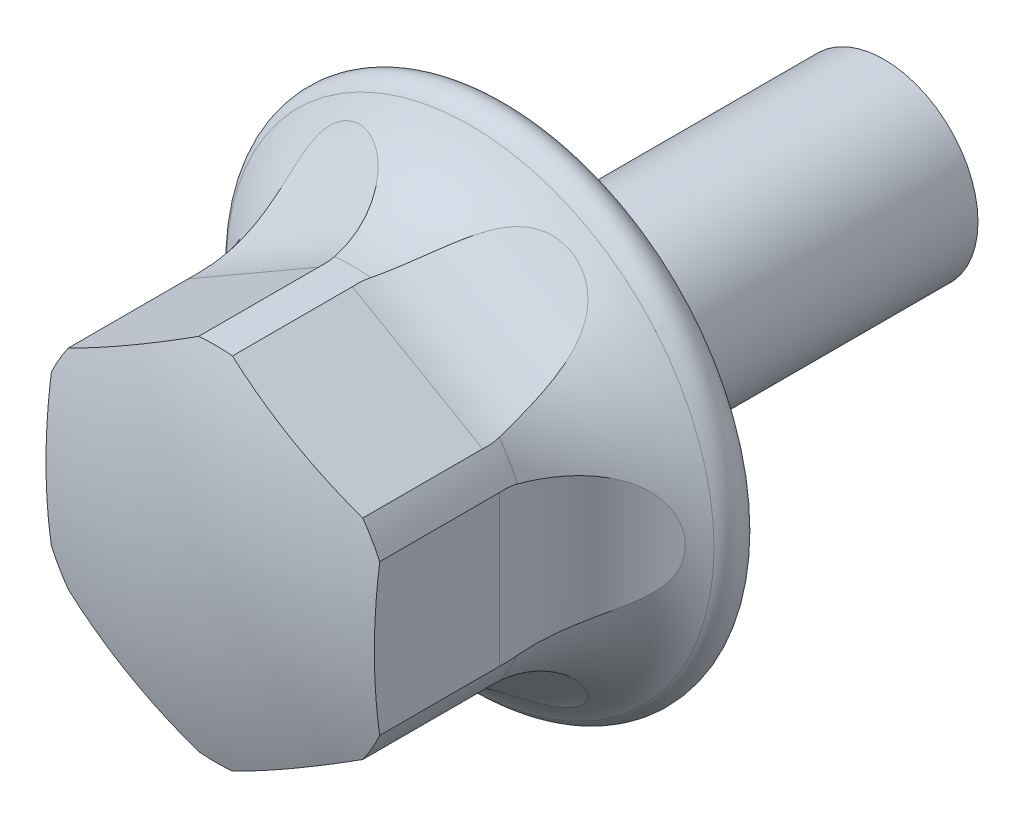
ISO-10303-21;
HEADER;
FILE_DESCRIPTION(('STEP AP214'),'2;1');
FILE_NAME('part.step','',(''),(''),'','','');
FILE_SCHEMA(('AUTOMOTIVE_DESIGN { 1 0 10303 214 1 1 1 1 }'));
ENDSEC;
DATA;
#1=APPLICATION_CONTEXT('core data for automotive mechanical design processes');
#2=APPLICATION_PROTOCOL_DEFINITION('international standard','automotive_design',2000,#1);
#3=PRODUCT_CONTEXT('',#1,'mechanical');
#4=PRODUCT('Part','Part','',(#3));
#5=PRODUCT_RELATED_PRODUCT_CATEGORY('part','',(#4));
#6=PRODUCT_DEFINITION_FORMATION('','',#4);
#7=PRODUCT_DEFINITION_CONTEXT('part definition',#1,'design');
#8=PRODUCT_DEFINITION('design','',#6,#7);
#9=PRODUCT_DEFINITION_SHAPE('','',#8);
#10=(LENGTH_UNIT() NAMED_UNIT(*) SI_UNIT(.MILLI.,.METRE.));
#11=(NAMED_UNIT(*) PLANE_ANGLE_UNIT() SI_UNIT($,.RADIAN.));
#12=(NAMED_UNIT(*) SI_UNIT($,.STERADIAN.) SOLID_ANGLE_UNIT());
#13=UNCERTAINTY_MEASURE_WITH_UNIT(LENGTH_MEASURE(1.E-05),#10,'distance_accuracy_value','');
#14=(GEOMETRIC_REPRESENTATION_CONTEXT(3) GLOBAL_UNCERTAINTY_ASSIGNED_CONTEXT((#13)) GLOBAL_UNIT_ASSIGNED_CONTEXT((#10,
#11,#12)) REPRESENTATION_CONTEXT('',''));
#15=CARTESIAN_POINT('',(0.,0.,0.));
#16=DIRECTION('',(0.,0.,1.));
#17=DIRECTION('',(1.,0.,0.));
#18=AXIS2_PLACEMENT_3D('',#15,#16,#17);
#19=CARTESIAN_POINT('',(0.,0.,0.));
#20=DIRECTION('',(0.,0.,1.));
#21=DIRECTION('',(1.,0.,0.));
#22=AXIS2_PLACEMENT_3D('',#19,#20,#21);
#23=CYLINDRICAL_SURFACE('',#22,3.85);
#24=DIRECTION('',(0.,0.,1.));
#25=VECTOR('',#24,1.);
#26=CARTESIAN_POINT('',(0.360980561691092,3.8330396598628,0.));
#27=LINE('',#26,#25);
#28=CARTESIAN_POINT('',(0.360980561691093,3.8330396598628,3.7));
#29=VERTEX_POINT('',#28);
#30=CARTESIAN_POINT('',(0.360980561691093,3.8330396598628,6.25454860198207));
#31=VERTEX_POINT('',#30);
#32=EDGE_CURVE('E285',#29,#31,#27,.T.);
#33=ORIENTED_EDGE('',*,*,#32,.F.);
#34=CARTESIAN_POINT('',(3.14133213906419,2.22587789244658,3.6));
#35=CARTESIAN_POINT('',(3.14132972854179,2.22588680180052,3.67209261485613));
#36=CARTESIAN_POINT('',(3.13772805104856,2.23099205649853,3.74427829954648));
#37=CARTESIAN_POINT('',(3.12329618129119,2.25114755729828,3.8866251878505));
#38=CARTESIAN_POINT('',(3.11244895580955,2.26622123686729,3.95678121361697));
#39=CARTESIAN_POINT('',(3.0835648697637,2.30536630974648,4.09278988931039));
#40=CARTESIAN_POINT('',(3.06554520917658,2.3294161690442,4.15865239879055));
#41=CARTESIAN_POINT('',(3.02242675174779,2.38509307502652,4.28453173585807));
#42=CARTESIAN_POINT('',(2.99733125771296,2.4167165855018,4.344551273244));
#43=CARTESIAN_POINT('',(2.93955899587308,2.48668377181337,4.45899291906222));
#44=CARTESIAN_POINT('',(2.90670406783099,2.52517918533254,4.51323167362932));
#45=CARTESIAN_POINT('',(2.834218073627,2.60627411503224,4.61347454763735));
#46=CARTESIAN_POINT('',(2.79458433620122,2.64887524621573,4.65947540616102));
#47=CARTESIAN_POINT('',(2.70521902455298,2.74020561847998,4.74668734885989));
#48=CARTESIAN_POINT('',(2.65489561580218,2.7891390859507,4.78707640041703));
#49=CARTESIAN_POINT('',(2.5477903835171,2.88730860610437,4.85760178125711));
#50=CARTESIAN_POINT('',(2.49100544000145,2.93654479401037,4.88773312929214));
#51=CARTESIAN_POINT('',(2.36485016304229,3.03930226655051,4.94098195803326));
#52=CARTESIAN_POINT('',(2.29478688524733,3.09263171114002,4.96282947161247));
#53=CARTESIAN_POINT('',(2.14930325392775,3.19545725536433,4.994345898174));
#54=CARTESIAN_POINT('',(2.07388008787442,3.2449513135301,5.0040083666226));
#55=CARTESIAN_POINT('',(1.91182641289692,3.34323636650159,5.01171324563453));
#56=CARTESIAN_POINT('',(1.82481601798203,3.39150087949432,5.00854732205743));
#57=CARTESIAN_POINT('',(1.64867265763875,3.48053494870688,4.98772705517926));
#58=CARTESIAN_POINT('',(1.55953898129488,3.52130195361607,4.97006779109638));
#59=CARTESIAN_POINT('',(1.3806473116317,3.59524964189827,4.9194149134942));
#60=CARTESIAN_POINT('',(1.29090203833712,3.62829894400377,4.88618119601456));
#61=CARTESIAN_POINT('',(1.11607614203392,3.68582821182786,4.80375685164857));
#62=CARTESIAN_POINT('',(1.03099276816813,3.71031327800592,4.75457575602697));
#63=CARTESIAN_POINT('',(0.876776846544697,3.74961025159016,4.64496546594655));
#64=CARTESIAN_POINT('',(0.806906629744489,3.76505601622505,4.58580750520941));
#65=CARTESIAN_POINT('',(0.678931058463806,3.7902259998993,4.45487866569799));
#66=CARTESIAN_POINT('',(0.620813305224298,3.79995626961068,4.38312123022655));
#67=CARTESIAN_POINT('',(0.526577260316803,3.81407903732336,4.23906105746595));
#68=CARTESIAN_POINT('',(0.488584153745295,3.81899981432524,4.16803379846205));
#69=CARTESIAN_POINT('',(0.426275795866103,3.82645839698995,4.02009144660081));
#70=CARTESIAN_POINT('',(0.401953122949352,3.8289974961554,3.94317957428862));
#71=CARTESIAN_POINT('',(0.369819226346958,3.83222761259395,3.79338854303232));
#72=CARTESIAN_POINT('',(0.36069113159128,3.83306758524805,3.72079246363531));
#73=CARTESIAN_POINT('',(0.355138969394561,3.83358665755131,3.57511986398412));
#74=CARTESIAN_POINT('',(0.358711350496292,3.83326608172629,3.50204348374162));
#75=CARTESIAN_POINT('',(0.378082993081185,3.83140185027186,3.35993726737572));
#76=CARTESIAN_POINT('',(0.393488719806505,3.82989752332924,3.29085270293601));
#77=CARTESIAN_POINT('',(0.43541385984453,3.82535691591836,3.15620987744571));
#78=CARTESIAN_POINT('',(0.461932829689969,3.82232069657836,3.09065147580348));
#79=CARTESIAN_POINT('',(0.525482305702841,3.8141059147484,2.9637516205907));
#80=CARTESIAN_POINT('',(0.562666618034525,3.80889545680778,2.90248951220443));
#81=CARTESIAN_POINT('',(0.645851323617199,3.79567451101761,2.78663451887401));
#82=CARTESIAN_POINT('',(0.691853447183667,3.78766347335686,2.73204294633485));
#83=CARTESIAN_POINT('',(0.793941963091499,3.76762742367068,2.62730956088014));
#84=CARTESIAN_POINT('',(0.850472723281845,3.75538709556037,2.57764331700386));
#85=CARTESIAN_POINT('',(0.969298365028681,3.72648654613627,2.48733296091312));
#86=CARTESIAN_POINT('',(1.03159558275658,3.70982452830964,2.44669252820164));
#87=CARTESIAN_POINT('',(1.16665056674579,3.66972569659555,2.37073273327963));
#88=CARTESIAN_POINT('',(1.23981909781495,3.64576027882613,2.33642416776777));
#89=CARTESIAN_POINT('',(1.38823431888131,3.59187298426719,2.27873434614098));
#90=CARTESIAN_POINT('',(1.46348205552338,3.56194805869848,2.25535870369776));
#91=CARTESIAN_POINT('',(1.62292979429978,3.49242319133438,2.21708076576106));
#92=CARTESIAN_POINT('',(1.70713440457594,3.45209709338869,2.2035101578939));
#93=CARTESIAN_POINT('',(1.87322046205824,3.36487137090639,2.18933908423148));
#94=CARTESIAN_POINT('',(1.95510068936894,3.31796836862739,2.18874530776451));
#95=CARTESIAN_POINT('',(2.1203235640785,3.21509841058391,2.20095385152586));
#96=CARTESIAN_POINT('',(2.2033417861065,3.15872083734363,2.21473059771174));
#97=CARTESIAN_POINT('',(2.36220399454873,3.04174621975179,2.25758442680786));
#98=CARTESIAN_POINT('',(2.43804730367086,2.9811487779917,2.28666295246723));
#99=CARTESIAN_POINT('',(2.57902416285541,2.85999818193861,2.3599068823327));
#100=CARTESIAN_POINT('',(2.64434850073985,2.79947059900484,2.40374408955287));
#101=CARTESIAN_POINT('',(2.76433887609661,2.68104952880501,2.50686671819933));
#102=CARTESIAN_POINT('',(2.81901589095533,2.62315337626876,2.56613608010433));
#103=CARTESIAN_POINT('',(2.9109311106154,2.52055788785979,2.69208328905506));
#104=CARTESIAN_POINT('',(2.94942597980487,2.47510744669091,2.75722909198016));
#105=CARTESIAN_POINT('',(3.01615970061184,2.39334071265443,2.89778338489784));
#106=CARTESIAN_POINT('',(3.0444018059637,2.35702152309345,2.97318860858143));
#107=CARTESIAN_POINT('',(3.08744702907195,2.30027918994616,3.12193102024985));
#108=CARTESIAN_POINT('',(3.10347518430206,2.27845103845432,3.19438350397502));
#109=CARTESIAN_POINT('',(3.12728289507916,2.24566806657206,3.3428671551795));
#110=CARTESIAN_POINT('',(3.13508644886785,2.23468161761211,3.41888723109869));
#111=CARTESIAN_POINT('',(3.14049004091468,2.22706492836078,3.53018309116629));
#112=CARTESIAN_POINT('',(3.14133330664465,2.2258735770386,3.56508062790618));
#113=CARTESIAN_POINT('',(3.14133213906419,2.22587789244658,3.6));
#114=B_SPLINE_CURVE_WITH_KNOTS('',3,(#34,#35,#36,#37,#38,#39,#40,#41,#42,#43,#44,#45,#46,#47,
#48,#49,#50,#51,#52,#53,#54,#55,#56,#57,#58,#59,#60,#61,#62,#63,#64,#65,#66,#67,#68,#69,#70,#71,
#72,#73,#74,#75,#76,#77,#78,#79,#80,#81,#82,#83,#84,#85,#86,#87,#88,#89,#90,#91,#92,#93,#94,#95,
#96,#97,#98,#99,#100,#101,#102,#103,#104,#105,#106,#107,#108,#109,#110,#111,#112,#113),
.UNSPECIFIED.,.T.,.F.,(4,2,2,2,2,2,2,2,2,2,2,2,2,2,2,2,2,2,2,2,2,2,2,2,2,2,2,2,2,2,2,2,2,2,2,2,
2,2,2,4),(0.,0.216172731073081,0.432855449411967,0.64902164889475,0.865087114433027,
1.08670191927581,1.3084042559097,1.55036947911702,1.79245203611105,2.06348945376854,
2.33467016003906,2.63195985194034,2.92935052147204,3.23148484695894,3.5334389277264,
3.81034897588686,4.08696534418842,4.32773862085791,4.56838105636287,4.78681066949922,
5.00517920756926,5.21658420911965,5.42798077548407,5.64259400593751,5.85724939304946,
6.08501804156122,6.3128793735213,6.56473225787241,6.81671431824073,7.09854455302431,
7.38052006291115,7.68294063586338,7.9853897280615,8.28151430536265,8.57733194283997,
8.84061034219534,9.10380511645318,9.33465462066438,9.56482865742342,9.66953586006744),.UNSPECIFIED.);
#115=CARTESIAN_POINT('',(0.38626604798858,3.83057417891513,3.33));
#116=VERTEX_POINT('',#115);
#117=EDGE_CURVE('E354',#29,#116,#114,.T.);
#118=ORIENTED_EDGE('',*,*,#117,.T.);
#119=CARTESIAN_POINT('',(0.,0.,3.33));
#120=DIRECTION('',(0.,0.,1.));
#121=DIRECTION('',(1.,0.,0.));
#122=AXIS2_PLACEMENT_3D('',#119,#120,#121);
#123=CIRCLE('',#122,3.85);
#124=CARTESIAN_POINT('',(-0.386266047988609,3.83057417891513,3.33));
#125=VERTEX_POINT('',#124);
#126=EDGE_CURVE('E267',#116,#125,#123,.T.);
#127=ORIENTED_EDGE('',*,*,#126,.T.);
#128=CARTESIAN_POINT('',(-0.357000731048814,3.83341238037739,3.6));
#129=CARTESIAN_POINT('',(-0.357009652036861,3.83341474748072,3.67209261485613));
#130=CARTESIAN_POINT('',(-0.36323177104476,3.83284823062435,3.74427829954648));
#131=CARTESIAN_POINT('',(-0.387902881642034,3.83042761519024,3.8866251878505));
#132=CARTESIAN_POINT('',(-0.406380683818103,3.82857048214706,3.95678121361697));
#133=CARTESIAN_POINT('',(-0.454723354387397,3.82312866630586,4.09278988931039));
#134=CARTESIAN_POINT('',(-0.484560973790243,3.8195481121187,4.15865239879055));
#135=CARTESIAN_POINT('',(-0.554337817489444,3.81004488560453,4.28453173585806));
#136=CARTESIAN_POINT('',(-0.594272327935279,3.80412330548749,4.34455127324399));
#137=CARTESIAN_POINT('',(-0.683751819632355,3.78907465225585,4.45899291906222));
#138=CARTESIAN_POINT('',(-0.733517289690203,3.77986915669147,4.51323167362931));
#139=CARTESIAN_POINT('',(-0.839990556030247,3.75764190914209,4.61347454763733));
#140=CARTESIAN_POINT('',(-0.896701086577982,3.74461865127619,4.65947540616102));
#141=CARTESIAN_POINT('',(-1.02047816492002,3.71289120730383,4.74668734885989));
#142=CARTESIAN_POINT('',(-1.08801749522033,3.69377659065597,4.78707640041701));
#143=CARTESIAN_POINT('',(-1.22658740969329,3.65010549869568,4.85760178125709));
#144=CARTESIAN_POINT('',(-1.29761967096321,3.62554638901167,4.88773312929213));
#145=CARTESIAN_POINT('',(-1.44968789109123,3.56767145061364,4.94098195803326));
#146=CARTESIAN_POINT('',(-1.53090418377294,3.53365959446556,4.96282947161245));
#147=CARTESIAN_POINT('',(-1.69269553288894,3.45907984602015,4.99434589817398));
#148=CARTESIAN_POINT('',(-1.77327022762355,3.41850849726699,5.0040083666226));
#149=CARTESIAN_POINT('',(-1.9394144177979,3.3273084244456,5.01171324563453));
#150=CARTESIAN_POINT('',(-2.02471790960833,3.27608746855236,5.00854732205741));
#151=CARTESIAN_POINT('',(-2.18989535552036,3.16805987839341,4.98772705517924));
#152=CARTESIAN_POINT('',(-2.26976745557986,3.1112513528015,4.97006779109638));
#153=CARTESIAN_POINT('',(-2.42325386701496,2.99330046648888,4.9194149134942));
#154=CARTESIAN_POINT('',(-2.49674803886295,2.93210343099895,4.88618119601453));
#155=CARTESIAN_POINT('',(-2.63398279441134,2.80946439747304,4.80375685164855));
#156=CARTESIAN_POINT('',(-2.69772917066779,2.7480225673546,4.75457575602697));
#157=CARTESIAN_POINT('',(-2.80886930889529,2.6341161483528,4.64496546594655));
#158=CARTESIAN_POINT('',(-2.85718084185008,2.58132964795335,4.5858075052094));
#159=CARTESIAN_POINT('',(-2.94296647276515,2.48308454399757,4.45487866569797));
#160=CARTESIAN_POINT('',(-2.98045201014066,2.43761822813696,4.38312123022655));
#161=CARTESIAN_POINT('',(-3.03980070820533,2.36306880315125,4.23906105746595));
#162=CARTESIAN_POINT('',(-3.06305877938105,2.33262619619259,4.16803379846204));
#163=CARTESIAN_POINT('',(-3.10067228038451,2.28239486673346,4.0200914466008));
#164=CARTESIAN_POINT('',(-3.11503254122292,2.26260036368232,3.94317957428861));
#165=CARTESIAN_POINT('',(-3.13389685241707,2.23638665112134,3.79338854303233));
#166=CARTESIAN_POINT('',(-3.13918833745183,2.22890147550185,3.72079246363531));
#167=CARTESIAN_POINT('',(-3.14241394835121,2.22435269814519,3.57511986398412));
#168=CARTESIAN_POINT('',(-3.14035013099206,2.22728618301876,3.50204348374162));
#169=CARTESIAN_POINT('',(-3.12904983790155,2.24313040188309,3.35993726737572));
#170=CARTESIAN_POINT('',(-3.12004418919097,2.25571998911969,3.29085270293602));
#171=CARTESIAN_POINT('',(-3.09514933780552,2.2897579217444,3.15620987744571));
#172=CARTESIAN_POINT('',(-3.0792604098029,2.31120591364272,3.09065147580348));
#173=CARTESIAN_POINT('',(-3.04037146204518,2.36213398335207,2.9637516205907));
#174=CARTESIAN_POINT('',(-3.0172669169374,2.39173131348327,2.90248951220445));
#175=CARTESIAN_POINT('',(-2.96422488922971,2.45716090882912,2.78663451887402));
#176=CARTESIAN_POINT('',(-2.93428606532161,2.49299439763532,2.73204294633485));
#177=CARTESIAN_POINT('',(-2.86589007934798,2.57138762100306,2.62730956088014));
#178=CARTESIAN_POINT('',(-2.82702426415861,2.614224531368,2.57764331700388));
#179=CARTESIAN_POINT('',(-2.7425828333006,2.7026802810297,2.48733296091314));
#180=CARTESIAN_POINT('',(-2.69700449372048,2.74830024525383,2.44669252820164));
#181=CARTESIAN_POINT('',(-2.5947503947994,2.84521187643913,2.37073273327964));
#182=CARTESIAN_POINT('',(-2.5374114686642,2.89659497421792,2.33642416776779));
#183=CARTESIAN_POINT('',(-2.41653609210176,2.99818267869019,2.278734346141));
#184=CARTESIAN_POINT('',(-2.35299647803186,3.04838666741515,2.25535870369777));
#185=CARTESIAN_POINT('',(-2.21306230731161,3.15171002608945,2.21708076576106));
#186=CARTESIAN_POINT('',(-2.13603657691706,3.20447030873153,2.20351015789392));
#187=CARTESIAN_POINT('',(-1.9774538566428,3.30469219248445,2.1893390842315));
#188=CARTESIAN_POINT('',(-1.89589455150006,3.35215104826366,2.18874530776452));
#189=CARTESIAN_POINT('',(-1.7241951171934,3.44380327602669,2.20095385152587));
#190=CARTESIAN_POINT('',(-1.6338615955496,3.48751037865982,2.21473059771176));
#191=CARTESIAN_POINT('',(-1.45312750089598,3.56660177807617,2.25758442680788));
#192=CARTESIAN_POINT('',(-1.36272692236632,3.60198528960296,2.28666295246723));
#193=CARTESIAN_POINT('',(-1.18731899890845,3.66349953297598,2.3599068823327));
#194=CARTESIAN_POINT('',(-1.10223840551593,3.68980827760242,2.40374408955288));
#195=CARTESIAN_POINT('',(-0.939687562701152,3.73451245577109,2.50686671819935));
#196=CARTESIAN_POINT('',(-0.862209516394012,3.75291606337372,2.56613608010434));
#197=CARTESIAN_POINT('',(-0.727401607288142,3.78121923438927,2.69208328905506));
#198=CARTESIAN_POINT('',(-0.668792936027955,3.79183154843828,2.75722909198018));
#199=CARTESIAN_POINT('',(-0.56461400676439,3.80874127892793,2.89778338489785));
#200=CARTESIAN_POINT('',(-0.519039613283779,3.81504006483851,2.97318860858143));
#201=CARTESIAN_POINT('',(-0.448376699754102,3.82394715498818,3.12193102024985));
#202=CARTESIAN_POINT('',(-0.421458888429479,3.82691386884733,3.19438350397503));
#203=CARTESIAN_POINT('',(-0.381164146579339,3.83114046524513,3.34286715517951));
#204=CARTESIAN_POINT('',(-0.367747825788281,3.83240531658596,3.41888723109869));
#205=CARTESIAN_POINT('',(-0.35844978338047,3.83327661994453,3.53018309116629));
#206=CARTESIAN_POINT('',(-0.356996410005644,3.83341123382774,3.56508062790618));
#207=CARTESIAN_POINT('',(-0.357000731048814,3.83341238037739,3.6));
#208=B_SPLINE_CURVE_WITH_KNOTS('',3,(#128,#129,#130,#131,#132,#133,#134,#135,#136,#137,#138,
#139,#140,#141,#142,#143,#144,#145,#146,#147,#148,#149,#150,#151,#152,#153,#154,#155,#156,#157,
#158,#159,#160,#161,#162,#163,#164,#165,#166,#167,#168,#169,#170,#171,#172,#173,#174,#175,#176,
#177,#178,#179,#180,#181,#182,#183,#184,#185,#186,#187,#188,#189,#190,#191,#192,#193,#194,#195,
#196,#197,#198,#199,#200,#201,#202,#203,#204,#205,#206,#207),.UNSPECIFIED.,.T.,.F.,(4,2,2,2,2,2,
2,2,2,2,2,2,2,2,2,2,2,2,2,2,2,2,2,2,2,2,2,2,2,2,2,2,2,2,2,2,2,2,2,4),(0.,0.21617273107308,
0.432855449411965,0.649021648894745,0.865087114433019,1.0867019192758,1.30840425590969,
1.550369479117,1.79245203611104,2.06348945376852,2.33467016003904,2.63195985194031,
2.92935052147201,3.23148484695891,3.53343892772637,3.81034897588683,4.08696534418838,
4.32773862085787,4.56838105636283,4.78681066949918,5.00517920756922,5.2165842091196,
5.42798077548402,5.64259400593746,5.8572493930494,6.08501804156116,6.31287937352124,
6.56473225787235,6.81671431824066,7.09854455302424,7.38052006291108,7.68294063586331,
7.98538972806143,8.28151430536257,8.57733194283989,8.84061034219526,9.10380511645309,
9.33465462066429,9.56482865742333,9.66953586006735),.UNSPECIFIED.);
#209=CARTESIAN_POINT('',(-0.360980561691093,3.83303965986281,3.7));
#210=VERTEX_POINT('',#209);
#211=EDGE_CURVE('E377',#125,#210,#208,.T.);
#212=ORIENTED_EDGE('',*,*,#211,.T.);
#213=DIRECTION('',(0.,0.,1.));
#214=VECTOR('',#213,1.);
#215=CARTESIAN_POINT('',(-0.360980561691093,3.8330396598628,0.));
#216=LINE('',#215,#214);
#217=CARTESIAN_POINT('',(-0.360980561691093,3.83303965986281,6.25454860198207));
#218=VERTEX_POINT('',#217);
#219=EDGE_CURVE('E288',#218,#210,#216,.F.);
#220=ORIENTED_EDGE('',*,*,#219,.F.);
#221=CARTESIAN_POINT('',(0.,0.,6.25454860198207));
#222=DIRECTION('',(0.,0.,1.));
#223=DIRECTION('',(1.,0.,0.));
#224=AXIS2_PLACEMENT_3D('',#221,#222,#223);
#225=CIRCLE('',#224,3.85);
#226=EDGE_CURVE('E281',#31,#218,#225,.T.);
#227=ORIENTED_EDGE('',*,*,#226,.F.);
#228=EDGE_LOOP('',(#33,#118,#127,#212,#220,#227));
#229=FACE_BOUND('',#228,.T.);
#230=ADVANCED_FACE('F16',(#229),#23,.T.);
#231=DIRECTION('',(0.,0.,1.));
#232=VECTOR('',#231,1.);
#233=CARTESIAN_POINT('',(3.13901943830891,-2.22913816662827,0.));
#234=LINE('',#233,#232);
#235=CARTESIAN_POINT('',(3.13901943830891,-2.22913816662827,3.7));
#236=VERTEX_POINT('',#235);
#237=CARTESIAN_POINT('',(3.13901943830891,-2.22913816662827,6.25454860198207));
#238=VERTEX_POINT('',#237);
#239=EDGE_CURVE('E172',#236,#238,#234,.T.);
#240=ORIENTED_EDGE('',*,*,#239,.F.);
#241=CARTESIAN_POINT('',(0.357000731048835,-3.83341238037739,3.6));
#242=CARTESIAN_POINT('',(0.357009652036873,-3.83341474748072,3.67209261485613));
#243=CARTESIAN_POINT('',(0.363231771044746,-3.83284823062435,3.74427829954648));
#244=CARTESIAN_POINT('',(0.387902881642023,-3.83042761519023,3.8866251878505));
#245=CARTESIAN_POINT('',(0.406380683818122,-3.82857048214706,3.95678121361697));
#246=CARTESIAN_POINT('',(0.454723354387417,-3.82312866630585,4.09278988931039));
#247=CARTESIAN_POINT('',(0.484560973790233,-3.8195481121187,4.15865239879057));
#248=CARTESIAN_POINT('',(0.554337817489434,-3.81004488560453,4.28453173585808));
#249=CARTESIAN_POINT('',(0.594272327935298,-3.80412330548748,4.34455127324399));
#250=CARTESIAN_POINT('',(0.68375181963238,-3.78907465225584,4.45899291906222));
#251=CARTESIAN_POINT('',(0.733517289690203,-3.77986915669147,4.51323167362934));
#252=CARTESIAN_POINT('',(0.839990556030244,-3.75764190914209,4.61347454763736));
#253=CARTESIAN_POINT('',(0.896701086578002,-3.74461865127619,4.65947540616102));
#254=CARTESIAN_POINT('',(1.02047816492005,-3.71289120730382,4.74668734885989));
#255=CARTESIAN_POINT('',(1.08801749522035,-3.69377659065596,4.78707640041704));
#256=CARTESIAN_POINT('',(1.22658740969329,-3.65010549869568,4.85760178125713));
#257=CARTESIAN_POINT('',(1.29761967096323,-3.62554638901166,4.88773312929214));
#258=CARTESIAN_POINT('',(1.44968789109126,-3.56767145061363,4.94098195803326));
#259=CARTESIAN_POINT('',(1.53090418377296,-3.53365959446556,4.96282947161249));
#260=CARTESIAN_POINT('',(1.69269553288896,-3.45907984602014,4.99434589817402));
#261=CARTESIAN_POINT('',(1.77327022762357,-3.41850849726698,5.0040083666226));
#262=CARTESIAN_POINT('',(1.93941441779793,-3.32730842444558,5.01171324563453));
#263=CARTESIAN_POINT('',(2.02471790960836,-3.27608746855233,5.00854732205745));
#264=CARTESIAN_POINT('',(2.18989535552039,-3.16805987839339,4.98772705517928));
#265=CARTESIAN_POINT('',(2.26976745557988,-3.11125135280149,4.97006779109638));
#266=CARTESIAN_POINT('',(2.42325386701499,-2.99330046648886,4.9194149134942));
#267=CARTESIAN_POINT('',(2.496748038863,-2.93210343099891,4.88618119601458));
#268=CARTESIAN_POINT('',(2.63398279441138,-2.809464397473,4.80375685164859));
#269=CARTESIAN_POINT('',(2.6977291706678,-2.74802256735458,4.75457575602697));
#270=CARTESIAN_POINT('',(2.80886930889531,-2.63411614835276,4.64496546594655));
#271=CARTESIAN_POINT('',(2.85718084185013,-2.58132964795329,4.58580750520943));
#272=CARTESIAN_POINT('',(2.9429664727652,-2.48308454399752,4.45487866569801));
#273=CARTESIAN_POINT('',(2.98045201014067,-2.43761822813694,4.38312123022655));
#274=CARTESIAN_POINT('',(3.03980070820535,-2.36306880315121,4.23906105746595));
#275=CARTESIAN_POINT('',(3.06305877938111,-2.33262619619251,4.16803379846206));
#276=CARTESIAN_POINT('',(3.10067228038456,-2.2823948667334,4.02009144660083));
#277=CARTESIAN_POINT('',(3.11503254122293,-2.2626003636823,3.94317957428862));
#278=CARTESIAN_POINT('',(3.13389685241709,-2.23638665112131,3.79338854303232));
#279=CARTESIAN_POINT('',(3.13918833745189,-2.22890147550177,3.72079246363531));
#280=CARTESIAN_POINT('',(3.14241394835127,-2.22435269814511,3.57511986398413));
#281=CARTESIAN_POINT('',(3.14035013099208,-2.22728618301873,3.50204348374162));
#282=CARTESIAN_POINT('',(3.12904983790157,-2.24313040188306,3.35993726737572));
#283=CARTESIAN_POINT('',(3.12004418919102,-2.25571998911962,3.290852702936));
#284=CARTESIAN_POINT('',(3.09514933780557,-2.28975792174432,3.1562098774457));
#285=CARTESIAN_POINT('',(3.07926040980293,-2.31120591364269,3.09065147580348));
#286=CARTESIAN_POINT('',(3.0403714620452,-2.36213398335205,2.9637516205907));
#287=CARTESIAN_POINT('',(3.01726691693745,-2.39173131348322,2.90248951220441));
#288=CARTESIAN_POINT('',(2.96422488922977,-2.45716090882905,2.78663451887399));
#289=CARTESIAN_POINT('',(2.93428606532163,-2.49299439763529,2.73204294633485));
#290=CARTESIAN_POINT('',(2.86589007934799,-2.57138762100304,2.62730956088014));
#291=CARTESIAN_POINT('',(2.82702426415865,-2.61422453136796,2.57764331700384));
#292=CARTESIAN_POINT('',(2.74258283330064,-2.70268028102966,2.4873329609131));
#293=CARTESIAN_POINT('',(2.69700449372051,-2.7483002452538,2.44669252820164));
#294=CARTESIAN_POINT('',(2.59475039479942,-2.84521187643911,2.37073273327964));
#295=CARTESIAN_POINT('',(2.53741146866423,-2.89659497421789,2.33642416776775));
#296=CARTESIAN_POINT('',(2.41653609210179,-2.99818267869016,2.27873434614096));
#297=CARTESIAN_POINT('',(2.35299647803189,-3.04838666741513,2.25535870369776));
#298=CARTESIAN_POINT('',(2.21306230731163,-3.15171002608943,2.21708076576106));
#299=CARTESIAN_POINT('',(2.13603657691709,-3.20447030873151,2.20351015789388));
#300=CARTESIAN_POINT('',(1.97745385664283,-3.30469219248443,2.18933908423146));
#301=CARTESIAN_POINT('',(1.89589455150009,-3.35215104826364,2.18874530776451));
#302=CARTESIAN_POINT('',(1.72419511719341,-3.44380327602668,2.20095385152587));
#303=CARTESIAN_POINT('',(1.63386159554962,-3.48751037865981,2.21473059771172));
#304=CARTESIAN_POINT('',(1.45312750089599,-3.56660177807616,2.25758442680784));
#305=CARTESIAN_POINT('',(1.36272692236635,-3.60198528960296,2.28666295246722));
#306=CARTESIAN_POINT('',(1.18731899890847,-3.66349953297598,2.35990688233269));
#307=CARTESIAN_POINT('',(1.10223840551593,-3.68980827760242,2.40374408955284));
#308=CARTESIAN_POINT('',(0.93968756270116,-3.73451245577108,2.50686671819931));
#309=CARTESIAN_POINT('',(0.862209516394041,-3.75291606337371,2.56613608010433));
#310=CARTESIAN_POINT('',(0.727401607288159,-3.78121923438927,2.69208328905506));
#311=CARTESIAN_POINT('',(0.668792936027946,-3.79183154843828,2.75722909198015));
#312=CARTESIAN_POINT('',(0.564614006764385,-3.80874127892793,2.89778338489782));
#313=CARTESIAN_POINT('',(0.519039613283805,-3.8150400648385,2.97318860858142));
#314=CARTESIAN_POINT('',(0.448376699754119,-3.82394715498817,3.12193102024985));
#315=CARTESIAN_POINT('',(0.421458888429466,-3.82691386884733,3.19438350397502));
#316=CARTESIAN_POINT('',(0.381164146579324,-3.83114046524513,3.34286715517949));
#317=CARTESIAN_POINT('',(0.367747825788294,-3.83240531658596,3.41888723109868));
#318=CARTESIAN_POINT('',(0.358449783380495,-3.83327661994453,3.53018309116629));
#319=CARTESIAN_POINT('',(0.356996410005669,-3.83341123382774,3.56508062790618));
#320=CARTESIAN_POINT('',(0.357000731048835,-3.83341238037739,3.6));
#321=B_SPLINE_CURVE_WITH_KNOTS('',3,(#241,#242,#243,#244,#245,#246,#247,#248,#249,#250,#251,
#252,#253,#254,#255,#256,#257,#258,#259,#260,#261,#262,#263,#264,#265,#266,#267,#268,#269,#270,
#271,#272,#273,#274,#275,#276,#277,#278,#279,#280,#281,#282,#283,#284,#285,#286,#287,#288,#289,
#290,#291,#292,#293,#294,#295,#296,#297,#298,#299,#300,#301,#302,#303,#304,#305,#306,#307,#308,
#309,#310,#311,#312,#313,#314,#315,#316,#317,#318,#319,#320),.UNSPECIFIED.,.T.,.F.,(4,2,2,2,2,2,
2,2,2,2,2,2,2,2,2,2,2,2,2,2,2,2,2,2,2,2,2,2,2,2,2,2,2,2,2,2,2,2,2,4),(0.,0.216172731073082,
0.432855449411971,0.649021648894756,0.865087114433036,1.08670191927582,1.30840425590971,
1.55036947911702,1.79245203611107,2.06348945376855,2.33467016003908,2.63195985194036,
2.92935052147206,3.23148484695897,3.53343892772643,3.81034897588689,4.08696534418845,
4.32773862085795,4.56838105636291,4.78681066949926,5.00517920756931,5.2165842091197,
5.42798077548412,5.64259400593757,5.85724939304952,6.08501804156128,6.31287937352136,
6.56473225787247,6.81671431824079,7.09854455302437,7.38052006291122,7.68294063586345,
7.98538972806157,8.28151430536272,8.57733194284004,8.84061034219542,9.10380511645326,
9.33465462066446,9.5648286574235,9.66953586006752),.UNSPECIFIED.);
#322=CARTESIAN_POINT('',(3.12424152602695,-2.24980329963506,3.33));
#323=VERTEX_POINT('',#322);
#324=EDGE_CURVE('E147',#236,#323,#321,.T.);
#325=ORIENTED_EDGE('',*,*,#324,.T.);
#326=CARTESIAN_POINT('',(3.51050757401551,-1.58077087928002,3.33));
#327=VERTEX_POINT('',#326);
#328=EDGE_CURVE('E269',#323,#327,#123,.T.);
#329=ORIENTED_EDGE('',*,*,#328,.T.);
#330=CARTESIAN_POINT('',(3.51050757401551,-1.58077087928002,3.33));
#331=CARTESIAN_POINT('',(3.50736845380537,-1.58773583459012,3.36470736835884));
#332=CARTESIAN_POINT('',(3.50481753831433,-1.59335256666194,3.39972194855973));
#333=CARTESIAN_POINT('',(3.50093735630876,-1.60186234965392,3.47014589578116));
#334=CARTESIAN_POINT('',(3.4996080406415,-1.6047555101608,3.50555524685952));
#335=CARTESIAN_POINT('',(3.49752355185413,-1.60930179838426,3.61187097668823));
#336=CARTESIAN_POINT('',(3.4986555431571,-1.60685714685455,3.68304252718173));
#337=CARTESIAN_POINT('',(3.50586673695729,-1.59105899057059,3.82390497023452));
#338=CARTESIAN_POINT('',(3.51194853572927,-1.57769976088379,3.8935950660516));
#339=CARTESIAN_POINT('',(3.52845398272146,-1.54042986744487,4.02954284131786));
#340=CARTESIAN_POINT('',(3.53887711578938,-1.51652045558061,4.09580092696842));
#341=CARTESIAN_POINT('',(3.56315059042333,-1.45857658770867,4.2236823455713));
#342=CARTESIAN_POINT('',(3.57702732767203,-1.42446372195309,4.28526497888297));
#343=CARTESIAN_POINT('',(3.60685553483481,-1.34714718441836,4.40186488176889));
#344=CARTESIAN_POINT('',(3.62280767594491,-1.30394056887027,4.45688001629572));
#345=CARTESIAN_POINT('',(3.65634404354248,-1.20682786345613,4.56247270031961));
#346=CARTESIAN_POINT('',(3.67396889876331,-1.15243799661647,4.61259120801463));
#347=CARTESIAN_POINT('',(3.70837735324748,-1.03638904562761,4.70387204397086));
#348=CARTESIAN_POINT('',(3.72516066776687,-0.974727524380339,4.74503135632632));
#349=CARTESIAN_POINT('',(3.75817967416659,-0.839015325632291,4.82208960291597));
#350=CARTESIAN_POINT('',(3.77417647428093,-0.764343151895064,4.85699487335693));
#351=CARTESIAN_POINT('',(3.80215781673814,-0.610123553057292,4.91594254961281));
#352=CARTESIAN_POINT('',(3.81414021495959,-0.530573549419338,4.93997915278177));
#353=CARTESIAN_POINT('',(3.83432995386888,-0.358805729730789,4.97972898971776));
#354=CARTESIAN_POINT('',(3.84191909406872,-0.266206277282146,4.99411287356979));
#355=CARTESIAN_POINT('',(3.85031250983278,-0.0795869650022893,5.00998742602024));
#356=CARTESIAN_POINT('',(3.85111328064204,0.0144336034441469,5.01147143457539));
#357=CARTESIAN_POINT('',(3.84565718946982,0.208662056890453,5.00119839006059));
#358=CARTESIAN_POINT('',(3.83886611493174,0.308804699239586,4.98843918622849));
#359=CARTESIAN_POINT('',(3.81798689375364,0.505198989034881,4.94768946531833));
#360=CARTESIAN_POINT('',(3.80389807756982,0.60145027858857,4.91969755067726));
#361=CARTESIAN_POINT('',(3.77021282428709,0.785217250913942,4.84855081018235));
#362=CARTESIAN_POINT('',(3.75071701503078,0.872856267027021,4.80566971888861));
#363=CARTESIAN_POINT('',(3.70846633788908,1.03779381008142,4.70437115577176));
#364=CARTESIAN_POINT('',(3.68571418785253,1.11510085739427,4.64596660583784));
#365=CARTESIAN_POINT('',(3.64264043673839,1.24821797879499,4.52134337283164));
#366=CARTESIAN_POINT('',(3.62232083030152,1.30544628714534,4.45664253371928));
#367=CARTESIAN_POINT('',(3.58432807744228,1.40641866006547,4.31679483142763));
#368=CARTESIAN_POINT('',(3.56665206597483,1.45017737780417,4.24165944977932));
#369=CARTESIAN_POINT('',(3.53832905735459,1.51786316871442,4.09330816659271));
#370=CARTESIAN_POINT('',(3.5270804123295,1.54358277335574,4.02102122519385));
#371=CARTESIAN_POINT('',(3.50980666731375,1.58247228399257,3.87254804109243));
#372=CARTESIAN_POINT('',(3.50377955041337,1.59564703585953,3.79636331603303));
#373=CARTESIAN_POINT('',(3.49812117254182,1.60800549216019,3.65449602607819));
#374=CARTESIAN_POINT('',(3.49764727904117,1.60903269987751,3.58900466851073));
#375=CARTESIAN_POINT('',(3.50012573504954,1.60362722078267,3.49126749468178));
#376=CARTESIAN_POINT('',(3.50148511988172,1.60066401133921,3.45875338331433));
#377=CARTESIAN_POINT('',(3.50523322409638,1.59243762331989,3.39407203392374));
#378=CARTESIAN_POINT('',(3.50762210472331,1.58717408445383,3.36190485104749));
#379=CARTESIAN_POINT('',(3.51050757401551,1.58077087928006,3.33));
#380=B_SPLINE_CURVE_WITH_KNOTS('',3,(#330,#331,#332,#333,#334,#335,#336,#337,#338,#339,#340,
#341,#342,#343,#344,#345,#346,#347,#348,#349,#350,#351,#352,#353,#354,#355,#356,#357,#358,#359,
#360,#361,#362,#363,#364,#365,#366,#367,#368,#369,#370,#371,#372,#373,#374,#375,#376,#377,#378,
#379),.UNSPECIFIED.,.F.,.F.,(4,2,2,2,2,2,2,2,2,2,2,2,2,2,2,2,2,2,2,2,2,2,2,2,4),(0.,
0.106550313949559,0.213096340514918,0.425650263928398,0.638315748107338,0.850956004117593,
1.06527424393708,1.27966196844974,1.50681041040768,1.73403519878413,1.98491446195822,
2.23592750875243,2.51678405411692,2.79778559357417,3.0998773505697,3.40199682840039,
3.69883275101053,3.99542235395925,4.26008655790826,4.52446181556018,4.75587014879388,
4.98718905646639,5.18285377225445,5.2807976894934,5.37875695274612),.UNSPECIFIED.);
#381=CARTESIAN_POINT('',(3.5,-1.60390149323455,3.7));
#382=VERTEX_POINT('',#381);
#383=EDGE_CURVE('E328',#327,#382,#380,.T.);
#384=ORIENTED_EDGE('',*,*,#383,.T.);
#385=DIRECTION('',(0.,0.,1.));
#386=VECTOR('',#385,1.);
#387=CARTESIAN_POINT('',(3.5,-1.60390149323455,0.));
#388=LINE('',#387,#386);
#389=CARTESIAN_POINT('',(3.5,-1.60390149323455,6.25454860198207));
#390=VERTEX_POINT('',#389);
#391=EDGE_CURVE('E178',#390,#382,#388,.F.);
#392=ORIENTED_EDGE('',*,*,#391,.F.);
#393=EDGE_CURVE('E274',#238,#390,#225,.T.);
#394=ORIENTED_EDGE('',*,*,#393,.F.);
#395=EDGE_LOOP('',(#240,#325,#329,#384,#392,#394));
#396=FACE_BOUND('',#395,.T.);
#397=ADVANCED_FACE('F215',(#396),#23,.T.);
#398=CARTESIAN_POINT('',(-0.38626604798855,-3.83057417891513,3.33));
#399=VERTEX_POINT('',#398);
#400=CARTESIAN_POINT('',(0.386266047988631,-3.83057417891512,3.33));
#401=VERTEX_POINT('',#400);
#402=EDGE_CURVE('E164',#399,#401,#123,.T.);
#403=ORIENTED_EDGE('',*,*,#402,.T.);
#404=CARTESIAN_POINT('',(0.360980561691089,-3.83303965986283,3.7));
#405=VERTEX_POINT('',#404);
#406=EDGE_CURVE('E144',#401,#405,#321,.T.);
#407=ORIENTED_EDGE('',*,*,#406,.T.);
#408=DIRECTION('',(0.,0.,1.));
#409=VECTOR('',#408,1.);
#410=CARTESIAN_POINT('',(0.360980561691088,-3.83303965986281,0.));
#411=LINE('',#410,#409);
#412=CARTESIAN_POINT('',(0.360980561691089,-3.8330396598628,6.25454860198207));
#413=VERTEX_POINT('',#412);
#414=EDGE_CURVE('E160',#413,#405,#411,.F.);
#415=ORIENTED_EDGE('',*,*,#414,.F.);
#416=CARTESIAN_POINT('',(-0.360980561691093,-3.83303965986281,6.25454860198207));
#417=VERTEX_POINT('',#416);
#418=EDGE_CURVE('E317',#417,#413,#225,.T.);
#419=ORIENTED_EDGE('',*,*,#418,.F.);
#420=DIRECTION('',(0.,0.,1.));
#421=VECTOR('',#420,1.);
#422=CARTESIAN_POINT('',(-0.360980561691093,-3.8330396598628,0.));
#423=LINE('',#422,#421);
#424=CARTESIAN_POINT('',(-0.360980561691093,-3.83303965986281,3.7));
#425=VERTEX_POINT('',#424);
#426=EDGE_CURVE('E173',#425,#417,#423,.T.);
#427=ORIENTED_EDGE('',*,*,#426,.F.);
#428=CARTESIAN_POINT('',(-3.14133213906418,-2.22587789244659,3.6));
#429=CARTESIAN_POINT('',(-3.14132972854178,-2.22588680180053,3.67209261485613));
#430=CARTESIAN_POINT('',(-3.13772805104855,-2.23099205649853,3.74427829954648));
#431=CARTESIAN_POINT('',(-3.12329618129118,-2.2511475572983,3.8866251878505));
#432=CARTESIAN_POINT('',(-3.11244895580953,-2.26622123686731,3.95678121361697));
#433=CARTESIAN_POINT('',(-3.08356486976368,-2.3053663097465,4.09278988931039));
#434=CARTESIAN_POINT('',(-3.06554520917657,-2.32941616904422,4.15865239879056));
#435=CARTESIAN_POINT('',(-3.02242675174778,-2.38509307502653,4.28453173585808));
#436=CARTESIAN_POINT('',(-2.99733125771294,-2.41671658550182,4.34455127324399));
#437=CARTESIAN_POINT('',(-2.93955899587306,-2.48668377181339,4.45899291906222));
#438=CARTESIAN_POINT('',(-2.90670406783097,-2.52517918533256,4.51323167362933));
#439=CARTESIAN_POINT('',(-2.83421807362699,-2.60627411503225,4.61347454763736));
#440=CARTESIAN_POINT('',(-2.7945843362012,-2.64887524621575,4.65947540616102));
#441=CARTESIAN_POINT('',(-2.70521902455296,-2.74020561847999,4.74668734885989));
#442=CARTESIAN_POINT('',(-2.65489561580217,-2.78913908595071,4.78707640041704));
#443=CARTESIAN_POINT('',(-2.54779038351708,-2.88730860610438,4.85760178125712));
#444=CARTESIAN_POINT('',(-2.49100544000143,-2.93654479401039,4.88773312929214));
#445=CARTESIAN_POINT('',(-2.36485016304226,-3.03930226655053,4.94098195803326));
#446=CARTESIAN_POINT('',(-2.29478688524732,-3.09263171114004,4.96282947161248));
#447=CARTESIAN_POINT('',(-2.14930325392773,-3.19545725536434,4.99434589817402));
#448=CARTESIAN_POINT('',(-2.0738800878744,-3.24495131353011,5.0040083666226));
#449=CARTESIAN_POINT('',(-1.91182641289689,-3.3432363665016,5.01171324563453));
#450=CARTESIAN_POINT('',(-1.824816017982,-3.39150087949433,5.00854732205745));
#451=CARTESIAN_POINT('',(-1.64867265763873,-3.4805349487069,4.98772705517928));
#452=CARTESIAN_POINT('',(-1.55953898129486,-3.52130195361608,4.97006779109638));
#453=CARTESIAN_POINT('',(-1.38064731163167,-3.59524964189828,4.9194149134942));
#454=CARTESIAN_POINT('',(-1.29090203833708,-3.62829894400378,4.88618119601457));
#455=CARTESIAN_POINT('',(-1.11607614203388,-3.68582821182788,4.80375685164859));
#456=CARTESIAN_POINT('',(-1.03099276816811,-3.71031327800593,4.75457575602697));
#457=CARTESIAN_POINT('',(-0.876776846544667,-3.74961025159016,4.64496546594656));
#458=CARTESIAN_POINT('',(-0.806906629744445,-3.76505601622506,4.58580750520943));
#459=CARTESIAN_POINT('',(-0.678931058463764,-3.79022599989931,4.45487866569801));
#460=CARTESIAN_POINT('',(-0.620813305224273,-3.79995626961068,4.38312123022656));
#461=CARTESIAN_POINT('',(-0.526577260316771,-3.81407903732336,4.23906105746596));
#462=CARTESIAN_POINT('',(-0.488584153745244,-3.81899981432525,4.16803379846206));
#463=CARTESIAN_POINT('',(-0.426275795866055,-3.82645839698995,4.02009144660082));
#464=CARTESIAN_POINT('',(-0.401953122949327,-3.8289974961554,3.94317957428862));
#465=CARTESIAN_POINT('',(-0.369819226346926,-3.83222761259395,3.79338854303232));
#466=CARTESIAN_POINT('',(-0.360691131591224,-3.83306758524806,3.72079246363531));
#467=CARTESIAN_POINT('',(-0.355138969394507,-3.83358665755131,3.57511986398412));
#468=CARTESIAN_POINT('',(-0.358711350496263,-3.83326608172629,3.50204348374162));
#469=CARTESIAN_POINT('',(-0.378082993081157,-3.83140185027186,3.35993726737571));
#470=CARTESIAN_POINT('',(-0.393488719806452,-3.82989752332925,3.290852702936));
#471=CARTESIAN_POINT('',(-0.435413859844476,-3.82535691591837,3.1562098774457));
#472=CARTESIAN_POINT('',(-0.461932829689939,-3.82232069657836,3.09065147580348));
#473=CARTESIAN_POINT('',(-0.525482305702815,-3.81410591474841,2.9637516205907));
#474=CARTESIAN_POINT('',(-0.562666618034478,-3.80889545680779,2.90248951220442));
#475=CARTESIAN_POINT('',(-0.64585132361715,-3.79567451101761,2.78663451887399));
#476=CARTESIAN_POINT('',(-0.691853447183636,-3.78766347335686,2.73204294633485));
#477=CARTESIAN_POINT('',(-0.793941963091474,-3.76762742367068,2.62730956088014));
#478=CARTESIAN_POINT('',(-0.850472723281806,-3.75538709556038,2.57764331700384));
#479=CARTESIAN_POINT('',(-0.969298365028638,-3.72648654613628,2.4873329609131));
#480=CARTESIAN_POINT('',(-1.03159558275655,-3.70982452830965,2.44669252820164));
#481=CARTESIAN_POINT('',(-1.16665056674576,-3.66972569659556,2.37073273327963));
#482=CARTESIAN_POINT('',(-1.23981909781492,-3.64576027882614,2.33642416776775));
#483=CARTESIAN_POINT('',(-1.38823431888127,-3.5918729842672,2.27873434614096));
#484=CARTESIAN_POINT('',(-1.46348205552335,-3.56194805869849,2.25535870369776));
#485=CARTESIAN_POINT('',(-1.62292979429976,-3.49242319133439,2.21708076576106));
#486=CARTESIAN_POINT('',(-1.70713440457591,-3.4520970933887,2.20351015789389));
#487=CARTESIAN_POINT('',(-1.87322046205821,-3.36487137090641,2.18933908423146));
#488=CARTESIAN_POINT('',(-1.95510068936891,-3.3179683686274,2.18874530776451));
#489=CARTESIAN_POINT('',(-2.12032356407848,-3.21509841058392,2.20095385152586));
#490=CARTESIAN_POINT('',(-2.20334178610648,-3.15872083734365,2.21473059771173));
#491=CARTESIAN_POINT('',(-2.36220399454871,-3.0417462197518,2.25758442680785));
#492=CARTESIAN_POINT('',(-2.43804730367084,-2.98114877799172,2.28666295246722));
#493=CARTESIAN_POINT('',(-2.5790241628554,-2.85999818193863,2.35990688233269));
#494=CARTESIAN_POINT('',(-2.64434850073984,-2.79947059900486,2.40374408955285));
#495=CARTESIAN_POINT('',(-2.76433887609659,-2.68104952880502,2.50686671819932));
#496=CARTESIAN_POINT('',(-2.81901589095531,-2.62315337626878,2.56613608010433));
#497=CARTESIAN_POINT('',(-2.91093111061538,-2.5205578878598,2.69208328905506));
#498=CARTESIAN_POINT('',(-2.94942597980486,-2.47510744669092,2.75722909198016));
#499=CARTESIAN_POINT('',(-3.01615970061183,-2.39334071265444,2.89778338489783));
#500=CARTESIAN_POINT('',(-3.04440180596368,-2.35702152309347,2.97318860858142));
#501=CARTESIAN_POINT('',(-3.08744702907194,-2.30027918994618,3.12193102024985));
#502=CARTESIAN_POINT('',(-3.10347518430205,-2.27845103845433,3.19438350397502));
#503=CARTESIAN_POINT('',(-3.12728289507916,-2.24566806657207,3.3428671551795));
#504=CARTESIAN_POINT('',(-3.13508644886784,-2.23468161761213,3.41888723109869));
#505=CARTESIAN_POINT('',(-3.14049004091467,-2.2270649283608,3.53018309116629));
#506=CARTESIAN_POINT('',(-3.14133330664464,-2.22587357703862,3.56508062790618));
#507=CARTESIAN_POINT('',(-3.14133213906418,-2.22587789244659,3.6));
#508=B_SPLINE_CURVE_WITH_KNOTS('',3,(#428,#429,#430,#431,#432,#433,#434,#435,#436,#437,#438,
#439,#440,#441,#442,#443,#444,#445,#446,#447,#448,#449,#450,#451,#452,#453,#454,#455,#456,#457,
#458,#459,#460,#461,#462,#463,#464,#465,#466,#467,#468,#469,#470,#471,#472,#473,#474,#475,#476,
#477,#478,#479,#480,#481,#482,#483,#484,#485,#486,#487,#488,#489,#490,#491,#492,#493,#494,#495,
#496,#497,#498,#499,#500,#501,#502,#503,#504,#505,#506,#507),.UNSPECIFIED.,.T.,.F.,(4,2,2,2,2,2,
2,2,2,2,2,2,2,2,2,2,2,2,2,2,2,2,2,2,2,2,2,2,2,2,2,2,2,2,2,2,2,2,2,4),(0.,0.216172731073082,
0.432855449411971,0.649021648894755,0.865087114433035,1.08670191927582,1.3084042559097,
1.55036947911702,1.79245203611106,2.06348945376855,2.33467016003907,2.63195985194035,
2.92935052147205,3.23148484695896,3.53343892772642,3.81034897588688,4.08696534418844,
4.32773862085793,4.5683810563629,4.78681066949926,5.0051792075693,5.21658420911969,
5.42798077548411,5.64259400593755,5.8572493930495,6.08501804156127,6.31287937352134,
6.56473225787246,6.81671431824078,7.09854455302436,7.3805200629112,7.68294063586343,
7.98538972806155,8.2815143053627,8.57733194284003,8.8406103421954,9.10380511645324,
9.33465462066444,9.56482865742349,9.6695358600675),.UNSPECIFIED.);
#509=EDGE_CURVE('E475',#425,#399,#508,.T.);
#510=ORIENTED_EDGE('',*,*,#509,.T.);
#511=EDGE_LOOP('',(#403,#407,#415,#419,#427,#510));
#512=FACE_BOUND('',#511,.T.);
#513=ADVANCED_FACE('F158',(#512),#23,.T.);
#514=CARTESIAN_POINT('',(-3.12424152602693,2.24980329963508,3.33));
#515=VERTEX_POINT('',#514);
#516=CARTESIAN_POINT('',(-3.51050757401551,1.58077087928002,3.33));
#517=VERTEX_POINT('',#516);
#518=EDGE_CURVE('E261',#515,#517,#123,.T.);
#519=ORIENTED_EDGE('',*,*,#518,.T.);
#520=CARTESIAN_POINT('',(-3.85,0.,2.19062673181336));
#521=CARTESIAN_POINT('',(-3.84999669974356,0.0906227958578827,2.19062637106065));
#522=CARTESIAN_POINT('',(-3.84677654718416,0.181317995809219,2.19663266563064));
#523=CARTESIAN_POINT('',(-3.83412009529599,0.360739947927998,2.22081474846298));
#524=CARTESIAN_POINT('',(-3.82467485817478,0.449463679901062,2.23900803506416));
#525=CARTESIAN_POINT('',(-3.80029862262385,0.622813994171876,2.28799322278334));
#526=CARTESIAN_POINT('',(-3.78535691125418,0.70743220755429,2.31880974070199));
#527=CARTESIAN_POINT('',(-3.75136189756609,0.86986598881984,2.39342429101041));
#528=CARTESIAN_POINT('',(-3.73230999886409,0.947683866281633,2.43721789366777));
#529=CARTESIAN_POINT('',(-3.69182157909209,1.09493005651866,2.53862756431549));
#530=CARTESIAN_POINT('',(-3.67035361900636,1.16421527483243,2.59644081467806));
#531=CARTESIAN_POINT('',(-3.62804332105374,1.29004674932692,2.7248008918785));
#532=CARTESIAN_POINT('',(-3.60720052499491,1.34660254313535,2.79533811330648));
#533=CARTESIAN_POINT('',(-3.57152295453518,1.43835108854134,2.93781443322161));
#534=CARTESIAN_POINT('',(-3.55626413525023,1.47531917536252,3.00850555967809));
#535=CARTESIAN_POINT('',(-3.53041255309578,1.53616110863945,3.15610590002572));
#536=CARTESIAN_POINT('',(-3.51981698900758,1.56004281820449,3.23301134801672));
#537=CARTESIAN_POINT('',(-3.50534249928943,1.59227973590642,3.38289321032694));
#538=CARTESIAN_POINT('',(-3.50092127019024,1.60189407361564,3.4555491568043));
#539=CARTESIAN_POINT('',(-3.49744556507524,1.60947037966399,3.60158639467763));
#540=CARTESIAN_POINT('',(-3.49838956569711,1.60743565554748,3.67496747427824));
#541=CARTESIAN_POINT('',(-3.5054167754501,1.59204823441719,3.81767937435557));
#542=CARTESIAN_POINT('',(-3.51132028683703,1.57909122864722,3.88706233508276));
#543=CARTESIAN_POINT('',(-3.52744886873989,1.54272375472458,4.02249265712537));
#544=CARTESIAN_POINT('',(-3.5376737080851,1.51931384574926,4.08854019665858));
#545=CARTESIAN_POINT('',(-3.56161684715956,1.46230880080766,4.21643343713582));
#546=CARTESIAN_POINT('',(-3.57537840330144,1.42858649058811,4.27821414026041));
#547=CARTESIAN_POINT('',(-3.60502609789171,1.35202337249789,4.39525292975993));
#548=CARTESIAN_POINT('',(-3.62091262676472,1.30918088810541,4.45050981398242));
#549=CARTESIAN_POINT('',(-3.65435409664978,1.21282260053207,4.55658838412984));
#550=CARTESIAN_POINT('',(-3.67195226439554,1.158828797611,4.6069610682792));
#551=CARTESIAN_POINT('',(-3.70636883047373,1.0435285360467,4.69879377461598));
#552=CARTESIAN_POINT('',(-3.72318691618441,0.982219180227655,4.74025024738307));
#553=CARTESIAN_POINT('',(-3.75632524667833,0.847245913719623,4.81793443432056));
#554=CARTESIAN_POINT('',(-3.77241430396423,0.772960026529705,4.85317861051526));
#555=CARTESIAN_POINT('',(-3.80064092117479,0.619460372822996,4.91283950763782));
#556=CARTESIAN_POINT('',(-3.81277645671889,0.540244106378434,4.93725068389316));
#557=CARTESIAN_POINT('',(-3.83334548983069,0.369101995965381,4.97783488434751));
#558=CARTESIAN_POINT('',(-3.84116575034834,0.276786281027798,4.99268008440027));
#559=CARTESIAN_POINT('',(-3.85006231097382,0.0906520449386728,5.00952102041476));
#560=CARTESIAN_POINT('',(-3.85113511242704,-0.00316723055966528,5.0115100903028));
#561=CARTESIAN_POINT('',(-3.84626046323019,-0.197208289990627,5.00233730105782));
#562=CARTESIAN_POINT('',(-3.83976996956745,-0.297371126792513,4.99015828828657));
#563=CARTESIAN_POINT('',(-3.81946247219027,-0.493930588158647,4.95060908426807));
#564=CARTESIAN_POINT('',(-3.80564451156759,-0.590326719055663,4.92323690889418));
#565=CARTESIAN_POINT('',(-3.77239434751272,-0.774711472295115,4.85328850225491));
#566=CARTESIAN_POINT('',(-3.75305224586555,-0.862807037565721,4.81095387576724));
#567=CARTESIAN_POINT('',(-3.71099311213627,-1.02876027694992,4.71070754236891));
#568=CARTESIAN_POINT('',(-3.6882791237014,-1.10662706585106,4.65280984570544));
#569=CARTESIAN_POINT('',(-3.64512398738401,-1.24097935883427,4.52898578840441));
#570=CARTESIAN_POINT('',(-3.62469826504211,-1.29885851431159,4.46457002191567));
#571=CARTESIAN_POINT('',(-3.58639946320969,-1.40115436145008,4.3251478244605));
#572=CARTESIAN_POINT('',(-3.5685240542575,-1.44558338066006,4.25015118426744));
#573=CARTESIAN_POINT('',(-3.53978636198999,-1.51447495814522,4.10196497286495));
#574=CARTESIAN_POINT('',(-3.52832598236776,-1.54074176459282,4.02972641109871));
#575=CARTESIAN_POINT('',(-3.51061152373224,-1.58069361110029,3.8812407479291));
#576=CARTESIAN_POINT('',(-3.50435517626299,-1.59438413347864,3.80499540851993));
#577=CARTESIAN_POINT('',(-3.4980163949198,-1.60823873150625,3.65666766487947));
#578=CARTESIAN_POINT('',(-3.49751749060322,-1.60931534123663,3.58468650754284));
#579=CARTESIAN_POINT('',(-3.50166372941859,-1.6002737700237,3.4415912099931));
#580=CARTESIAN_POINT('',(-3.50630778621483,-1.59015795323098,3.37047688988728));
#581=CARTESIAN_POINT('',(-3.52015476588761,-1.55925854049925,3.23230036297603));
#582=CARTESIAN_POINT('',(-3.52928280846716,-1.53864996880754,3.16519124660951));
#583=CARTESIAN_POINT('',(-3.55117635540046,-1.4874197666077,3.03555916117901));
#584=CARTESIAN_POINT('',(-3.5639420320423,-1.4567976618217,2.97303640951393));
#585=CARTESIAN_POINT('',(-3.59232418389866,-1.38535902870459,2.85228661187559));
#586=CARTESIAN_POINT('',(-3.60801254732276,-1.34427281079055,2.79423653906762));
#587=CARTESIAN_POINT('',(-3.64051539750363,-1.25358065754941,2.68561466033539));
#588=CARTESIAN_POINT('',(-3.65733010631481,-1.20397303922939,2.63504433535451));
#589=CARTESIAN_POINT('',(-3.69190990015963,-1.09356650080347,2.53848153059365));
#590=CARTESIAN_POINT('',(-3.709650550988,-1.03220462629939,2.49312554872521));
#591=CARTESIAN_POINT('',(-3.74321776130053,-0.902932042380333,2.41203021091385));
#592=CARTESIAN_POINT('',(-3.75904280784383,-0.835016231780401,2.37629842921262));
#593=CARTESIAN_POINT('',(-3.78918756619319,-0.686261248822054,2.31082099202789));
#594=CARTESIAN_POINT('',(-3.80312441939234,-0.604834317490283,2.28223756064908));
#595=CARTESIAN_POINT('',(-3.8259028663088,-0.438210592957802,2.23663256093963));
#596=CARTESIAN_POINT('',(-3.8347491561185,-0.353017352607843,2.2196003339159));
#597=CARTESIAN_POINT('',(-3.84380599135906,-0.222772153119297,2.20231509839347));
#598=CARTESIAN_POINT('',(-3.84612407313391,-0.178365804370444,2.1979301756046));
#599=CARTESIAN_POINT('',(-3.84922182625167,-0.0893121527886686,2.19208620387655));
#600=CARTESIAN_POINT('',(-3.8500016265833,-0.04466487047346,2.19062690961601));
#601=CARTESIAN_POINT('',(-3.85,0.,2.19062673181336));
#602=B_SPLINE_CURVE_WITH_KNOTS('',3,(#520,#521,#522,#523,#524,#525,#526,#527,#528,#529,#530,
#531,#532,#533,#534,#535,#536,#537,#538,#539,#540,#541,#542,#543,#544,#545,#546,#547,#548,#549,
#550,#551,#552,#553,#554,#555,#556,#557,#558,#559,#560,#561,#562,#563,#564,#565,#566,#567,#568,
#569,#570,#571,#572,#573,#574,#575,#576,#577,#578,#579,#580,#581,#582,#583,#584,#585,#586,#587,
#588,#589,#590,#591,#592,#593,#594,#595,#596,#597,#598,#599,#600,#601),.UNSPECIFIED.,.T.,.F.,(4,
2,2,2,2,2,2,2,2,2,2,2,2,2,2,2,2,2,2,2,2,2,2,2,2,2,2,2,2,2,2,2,2,2,2,2,2,2,2,2,4),(0.,
0.271735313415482,0.543861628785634,0.816521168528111,1.08908774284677,1.36573625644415,
1.64217679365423,1.88449177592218,2.12666100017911,2.34583198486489,2.56494074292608,
2.77643672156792,2.98792138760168,3.20212715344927,3.41637232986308,3.64315949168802,
3.87003676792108,4.12036740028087,4.37082601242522,4.65112123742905,4.93156178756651,
5.233444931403,5.53536750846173,5.83262221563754,6.12961021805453,6.39498575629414,
6.66011732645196,6.89202820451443,7.12383793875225,7.33876456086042,7.55364579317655,
7.76505471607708,7.97647365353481,8.19401883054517,8.41160702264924,8.64566952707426,
8.87991570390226,9.14112107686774,9.40208509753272,9.5360253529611,9.66995437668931),.UNSPECIFIED.);
#603=CARTESIAN_POINT('',(-3.5,1.60390149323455,3.7));
#604=VERTEX_POINT('',#603);
#605=EDGE_CURVE('E359',#517,#604,#602,.T.);
#606=ORIENTED_EDGE('',*,*,#605,.T.);
#607=DIRECTION('',(0.,0.,1.));
#608=VECTOR('',#607,1.);
#609=CARTESIAN_POINT('',(-3.5,1.60390149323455,0.));
#610=LINE('',#609,#608);
#611=CARTESIAN_POINT('',(-3.5,1.60390149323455,6.25454860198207));
#612=VERTEX_POINT('',#611);
#613=EDGE_CURVE('E295',#612,#604,#610,.F.);
#614=ORIENTED_EDGE('',*,*,#613,.F.);
#615=CARTESIAN_POINT('',(-3.13901943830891,2.22913816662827,6.25454860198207));
#616=VERTEX_POINT('',#615);
#617=EDGE_CURVE('E316',#616,#612,#225,.T.);
#618=ORIENTED_EDGE('',*,*,#617,.F.);
#619=DIRECTION('',(0.,0.,1.));
#620=VECTOR('',#619,1.);
#621=CARTESIAN_POINT('',(-3.13901943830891,2.22913816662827,0.));
#622=LINE('',#621,#620);
#623=CARTESIAN_POINT('',(-3.13901943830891,2.22913816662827,3.7));
#624=VERTEX_POINT('',#623);
#625=EDGE_CURVE('E292',#624,#616,#622,.T.);
#626=ORIENTED_EDGE('',*,*,#625,.F.);
#627=EDGE_CURVE('E370',#624,#515,#208,.T.);
#628=ORIENTED_EDGE('',*,*,#627,.T.);
#629=EDGE_LOOP('',(#519,#606,#614,#618,#626,#628));
#630=FACE_BOUND('',#629,.T.);
#631=ADVANCED_FACE('F241',(#630),#23,.T.);
#632=CARTESIAN_POINT('',(-3.51050757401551,-1.58077087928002,3.33));
#633=VERTEX_POINT('',#632);
#634=CARTESIAN_POINT('',(-3.1242415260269,-2.24980329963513,3.33));
#635=VERTEX_POINT('',#634);
#636=EDGE_CURVE('E252',#633,#635,#123,.T.);
#637=ORIENTED_EDGE('',*,*,#636,.T.);
#638=CARTESIAN_POINT('',(-3.13901943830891,-2.22913816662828,3.7));
#639=VERTEX_POINT('',#638);
#640=EDGE_CURVE('E254',#635,#639,#508,.T.);
#641=ORIENTED_EDGE('',*,*,#640,.T.);
#642=DIRECTION('',(0.,0.,1.));
#643=VECTOR('',#642,1.);
#644=CARTESIAN_POINT('',(-3.13901943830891,-2.22913816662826,0.));
#645=LINE('',#644,#643);
#646=CARTESIAN_POINT('',(-3.13901943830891,-2.22913816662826,6.25454860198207));
#647=VERTEX_POINT('',#646);
#648=EDGE_CURVE('E181',#647,#639,#645,.F.);
#649=ORIENTED_EDGE('',*,*,#648,.F.);
#650=CARTESIAN_POINT('',(-3.5,-1.60390149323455,6.25454860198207));
#651=VERTEX_POINT('',#650);
#652=EDGE_CURVE('E311',#651,#647,#225,.T.);
#653=ORIENTED_EDGE('',*,*,#652,.F.);
#654=DIRECTION('',(0.,0.,1.));
#655=VECTOR('',#654,1.);
#656=CARTESIAN_POINT('',(-3.5,-1.60390149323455,0.));
#657=LINE('',#656,#655);
#658=CARTESIAN_POINT('',(-3.5,-1.60390149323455,3.7));
#659=VERTEX_POINT('',#658);
#660=EDGE_CURVE('E299',#659,#651,#657,.T.);
#661=ORIENTED_EDGE('',*,*,#660,.F.);
#662=EDGE_CURVE('E257',#659,#633,#602,.T.);
#663=ORIENTED_EDGE('',*,*,#662,.T.);
#664=EDGE_LOOP('',(#637,#641,#649,#653,#661,#663));
#665=FACE_BOUND('',#664,.T.);
#666=ADVANCED_FACE('F230',(#665),#23,.T.);
#667=CARTESIAN_POINT('',(0.,0.,-4.905));
#668=DIRECTION('',(0.,0.,1.));
#669=DIRECTION('',(-1.,0.,0.));
#670=AXIS2_PLACEMENT_3D('',#667,#668,#669);
#671=SPHERICAL_SURFACE('',#670,11.805);
#672=CARTESIAN_POINT('',(3.5,0.,-4.905));
#673=DIRECTION('',(1.,0.,0.));
#674=DIRECTION('',(0.,1.,0.));
#675=AXIS2_PLACEMENT_3D('',#672,#673,#674);
#676=CIRCLE('',#675,11.2742194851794);
#677=CARTESIAN_POINT('',(3.5,1.60390149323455,6.25454860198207));
#678=VERTEX_POINT('',#677);
#679=EDGE_CURVE('E36',#678,#390,#676,.T.);
#680=ORIENTED_EDGE('',*,*,#679,.F.);
#681=CARTESIAN_POINT('',(3.13901943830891,2.22913816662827,6.25454860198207));
#682=VERTEX_POINT('',#681);
#683=EDGE_CURVE('E276',#678,#682,#225,.T.);
#684=ORIENTED_EDGE('',*,*,#683,.T.);
#685=CARTESIAN_POINT('',(1.75,3.03108891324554,-4.905));
#686=DIRECTION('',(0.5,0.866025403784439,0.));
#687=DIRECTION('',(-0.866025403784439,0.5,0.));
#688=AXIS2_PLACEMENT_3D('',#685,#686,#687);
#689=CIRCLE('',#688,11.2742194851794);
#690=EDGE_CURVE('E333',#31,#682,#689,.T.);
#691=ORIENTED_EDGE('',*,*,#690,.F.);
#692=ORIENTED_EDGE('',*,*,#226,.T.);
#693=CARTESIAN_POINT('',(-1.75,3.03108891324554,-4.905));
#694=DIRECTION('',(-0.5,0.866025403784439,0.));
#695=DIRECTION('',(-0.866025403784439,-0.5,0.));
#696=AXIS2_PLACEMENT_3D('',#693,#694,#695);
#697=CIRCLE('',#696,11.2742194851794);
#698=EDGE_CURVE('E346',#616,#218,#697,.T.);
#699=ORIENTED_EDGE('',*,*,#698,.F.);
#700=ORIENTED_EDGE('',*,*,#617,.T.);
#701=CARTESIAN_POINT('',(-3.5,0.,-4.905));
#702=DIRECTION('',(-1.,0.,0.));
#703=DIRECTION('',(0.,0.,1.));
#704=AXIS2_PLACEMENT_3D('',#701,#702,#703);
#705=CIRCLE('',#704,11.2742194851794);
#706=EDGE_CURVE('E314',#651,#612,#705,.T.);
#707=ORIENTED_EDGE('',*,*,#706,.F.);
#708=ORIENTED_EDGE('',*,*,#652,.T.);
#709=CARTESIAN_POINT('',(-1.75,-3.03108891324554,-4.905));
#710=DIRECTION('',(-0.5,-0.866025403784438,0.));
#711=DIRECTION('',(0.866025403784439,-0.5,0.));
#712=AXIS2_PLACEMENT_3D('',#709,#710,#711);
#713=CIRCLE('',#712,11.2742194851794);
#714=EDGE_CURVE('E308',#417,#647,#713,.T.);
#715=ORIENTED_EDGE('',*,*,#714,.F.);
#716=ORIENTED_EDGE('',*,*,#418,.T.);
#717=CARTESIAN_POINT('',(1.75,-3.03108891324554,-4.905));
#718=DIRECTION('',(0.5,-0.866025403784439,0.));
#719=DIRECTION('',(0.866025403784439,0.5,0.));
#720=AXIS2_PLACEMENT_3D('',#717,#718,#719);
#721=CIRCLE('',#720,11.2742194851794);
#722=EDGE_CURVE('E170',#238,#413,#721,.T.);
#723=ORIENTED_EDGE('',*,*,#722,.F.);
#724=ORIENTED_EDGE('',*,*,#393,.T.);
#725=EDGE_LOOP('',(#680,#684,#691,#692,#699,#700,#707,#708,#715,#716,#723,#724));
#726=FACE_BOUND('',#725,.T.);
#727=ADVANCED_FACE('F228',(#726),#671,.T.);
#728=CARTESIAN_POINT('',(3.51050757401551,1.58077087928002,3.33));
#729=VERTEX_POINT('',#728);
#730=CARTESIAN_POINT('',(3.12424152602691,2.24980329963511,3.33));
#731=VERTEX_POINT('',#730);
#732=EDGE_CURVE('E270',#729,#731,#123,.T.);
#733=ORIENTED_EDGE('',*,*,#732,.T.);
#734=CARTESIAN_POINT('',(3.13901943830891,2.22913816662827,3.7));
#735=VERTEX_POINT('',#734);
#736=EDGE_CURVE('E356',#731,#735,#114,.T.);
#737=ORIENTED_EDGE('',*,*,#736,.T.);
#738=DIRECTION('',(0.,0.,1.));
#739=VECTOR('',#738,1.);
#740=CARTESIAN_POINT('',(3.13901943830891,2.22913816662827,0.));
#741=LINE('',#740,#739);
#742=EDGE_CURVE('E280',#682,#735,#741,.F.);
#743=ORIENTED_EDGE('',*,*,#742,.F.);
#744=ORIENTED_EDGE('',*,*,#683,.F.);
#745=DIRECTION('',(0.,0.,1.));
#746=VECTOR('',#745,1.);
#747=CARTESIAN_POINT('',(3.5,1.60390149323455,0.));
#748=LINE('',#747,#746);
#749=CARTESIAN_POINT('',(3.5,1.60390149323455,3.7));
#750=VERTEX_POINT('',#749);
#751=EDGE_CURVE('E32',#750,#678,#748,.T.);
#752=ORIENTED_EDGE('',*,*,#751,.F.);
#753=EDGE_CURVE('E337',#750,#729,#380,.T.);
#754=ORIENTED_EDGE('',*,*,#753,.T.);
#755=EDGE_LOOP('',(#733,#737,#743,#744,#752,#754));
#756=FACE_BOUND('',#755,.T.);
#757=ADVANCED_FACE('F218',(#756),#23,.T.);
#758=CARTESIAN_POINT('',(0.,0.,3.33));
#759=DIRECTION('',(0.,0.,1.));
#760=DIRECTION('',(1.,0.,0.));
#761=AXIS2_PLACEMENT_3D('',#758,#759,#760);
#762=TOROIDAL_SURFACE('',#761,6.85,3.);
#763=CARTESIAN_POINT('',(0.,0.,0.825652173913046));
#764=DIRECTION('',(0.,0.,1.));
#765=DIRECTION('',(1.,0.,0.));
#766=AXIS2_PLACEMENT_3D('',#763,#764,#765);
#767=CIRCLE('',#766,5.19826092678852);
#768=CARTESIAN_POINT('',(5.19826092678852,0.,0.825652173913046));
#769=VERTEX_POINT('',#768);
#770=EDGE_CURVE('E25',#769,#769,#767,.T.);
#771=ORIENTED_EDGE('',*,*,#770,.T.);
#772=EDGE_LOOP('',(#771));
#773=FACE_BOUND('',#772,.T.);
#774=CARTESIAN_POINT('',(3.12426725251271,2.24976758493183,3.3302));
#775=CARTESIAN_POINT('',(3.11344331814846,2.26474957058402,3.24626662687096));
#776=CARTESIAN_POINT('',(3.10477464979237,2.28261598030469,3.16257465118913));
#777=CARTESIAN_POINT('',(3.09114860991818,2.32430702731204,2.99636028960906));
#778=CARTESIAN_POINT('',(3.08619207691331,2.34813300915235,2.91383817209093));
#779=CARTESIAN_POINT('',(3.07937846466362,2.40206018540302,2.75028183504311));
#780=CARTESIAN_POINT('',(3.07753697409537,2.43219209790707,2.66925709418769));
#781=CARTESIAN_POINT('',(3.07617294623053,2.49881944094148,2.50986535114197));
#782=CARTESIAN_POINT('',(3.07664977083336,2.5353131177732,2.43149762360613));
#783=CARTESIAN_POINT('',(3.07865026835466,2.60767205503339,2.29194262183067));
#784=CARTESIAN_POINT('',(3.07997046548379,2.64247220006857,2.2301983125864));
#785=CARTESIAN_POINT('',(3.08268315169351,2.71652449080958,2.10944567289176));
#786=CARTESIAN_POINT('',(3.08407562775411,2.75577583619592,2.05043685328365));
#787=CARTESIAN_POINT('',(3.08596546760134,2.8386405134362,1.93581753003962));
#788=CARTESIAN_POINT('',(3.08646564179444,2.88223969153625,1.88019689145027));
#789=CARTESIAN_POINT('',(3.08535192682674,2.97382266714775,1.77275078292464));
#790=CARTESIAN_POINT('',(3.08373933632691,3.02180375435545,1.72092300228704));
#791=CARTESIAN_POINT('',(3.07624194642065,3.13094760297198,1.61278430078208));
#792=CARTESIAN_POINT('',(3.06964321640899,3.19293157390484,1.55733484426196));
#793=CARTESIAN_POINT('',(3.0482021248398,3.32163149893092,1.45402855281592));
#794=CARTESIAN_POINT('',(3.03337371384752,3.38833927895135,1.40615904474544));
#795=CARTESIAN_POINT('',(2.99601411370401,3.51119511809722,1.32777998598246));
#796=CARTESIAN_POINT('',(2.97548750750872,3.56693498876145,1.29570049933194));
#797=CARTESIAN_POINT('',(2.92540407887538,3.6778760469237,1.23827409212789));
#798=CARTESIAN_POINT('',(2.89585209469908,3.73307750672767,1.21292357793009));
#799=CARTESIAN_POINT('',(2.82703879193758,3.84070118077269,1.16927041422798));
#800=CARTESIAN_POINT('',(2.78771915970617,3.89310431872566,1.15101184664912));
#801=CARTESIAN_POINT('',(2.70012955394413,3.99219835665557,1.12180625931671));
#802=CARTESIAN_POINT('',(2.65185791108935,4.03888818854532,1.11086060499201));
#803=CARTESIAN_POINT('',(2.55324765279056,4.12008934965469,1.09685734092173));
#804=CARTESIAN_POINT('',(2.50362582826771,4.15535795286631,1.09310725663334));
#805=CARTESIAN_POINT('',(2.39981466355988,4.21854377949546,1.09125852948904));
#806=CARTESIAN_POINT('',(2.34562635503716,4.24646265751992,1.0931586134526));
#807=CARTESIAN_POINT('',(2.23464928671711,4.29401372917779,1.10262423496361));
#808=CARTESIAN_POINT('',(2.17788149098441,4.31370280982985,1.11014984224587));
#809=CARTESIAN_POINT('',(2.06314594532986,4.34468472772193,1.13095106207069));
#810=CARTESIAN_POINT('',(2.00517866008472,4.35598075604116,1.14422448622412));
#811=CARTESIAN_POINT('',(1.88994155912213,4.37032779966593,1.17657176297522));
#812=CARTESIAN_POINT('',(1.83267095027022,4.37338928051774,1.19563821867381));
#813=CARTESIAN_POINT('',(1.72044752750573,4.37212674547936,1.23941333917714));
#814=CARTESIAN_POINT('',(1.66549525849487,4.36780100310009,1.26412332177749));
#815=CARTESIAN_POINT('',(1.54063955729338,4.35059164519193,1.32831269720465));
#816=CARTESIAN_POINT('',(1.47218425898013,4.33525466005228,1.36993976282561));
#817=CARTESIAN_POINT('',(1.34303171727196,4.2976805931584,1.46135757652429));
#818=CARTESIAN_POINT('',(1.28235372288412,4.27542684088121,1.51116790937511));
#819=CARTESIAN_POINT('',(1.18187656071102,4.23317390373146,1.60515075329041));
#820=CARTESIAN_POINT('',(1.1404926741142,4.21384190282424,1.64796657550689));
#821=CARTESIAN_POINT('',(1.06191770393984,4.17449035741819,1.73702540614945));
#822=CARTESIAN_POINT('',(1.02472894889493,4.15447043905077,1.78327029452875));
#823=CARTESIAN_POINT('',(0.954103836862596,4.11471329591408,1.87879250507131));
#824=CARTESIAN_POINT('',(0.920674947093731,4.09497669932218,1.92807557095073));
#825=CARTESIAN_POINT('',(0.857244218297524,4.05658475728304,2.02920894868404));
#826=CARTESIAN_POINT('',(0.827243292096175,4.03792970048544,2.08105993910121));
#827=CARTESIAN_POINT('',(0.759866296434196,3.99576729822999,2.20640521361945));
#828=CARTESIAN_POINT('',(0.723820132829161,3.97298925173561,2.28086354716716));
#829=CARTESIAN_POINT('',(0.656657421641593,3.93171464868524,2.43313940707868));
#830=CARTESIAN_POINT('',(0.625542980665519,3.9132199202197,2.51095835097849));
#831=CARTESIAN_POINT('',(0.567657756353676,3.88137583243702,2.66905305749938));
#832=CARTESIAN_POINT('',(0.540879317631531,3.86801734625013,2.74932418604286));
#833=CARTESIAN_POINT('',(0.491058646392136,3.84701379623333,2.91174520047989));
#834=CARTESIAN_POINT('',(0.46801575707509,3.83936772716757,2.99389475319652));
#835=CARTESIAN_POINT('',(0.435731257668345,3.83247842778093,3.1186705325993));
#836=CARTESIAN_POINT('',(0.42527419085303,3.83095214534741,3.16087113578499));
#837=CARTESIAN_POINT('',(0.405164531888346,3.82953343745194,3.24542578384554));
#838=CARTESIAN_POINT('',(0.395510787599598,3.82963863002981,3.28777951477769));
#839=CARTESIAN_POINT('',(0.386222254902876,3.83057860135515,3.33019999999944));
#840=B_SPLINE_CURVE_WITH_KNOTS('',3,(#774,#775,#776,#777,#778,#779,#780,#781,#782,#783,#784,
#785,#786,#787,#788,#789,#790,#791,#792,#793,#794,#795,#796,#797,#798,#799,#800,#801,#802,#803,
#804,#805,#806,#807,#808,#809,#810,#811,#812,#813,#814,#815,#816,#817,#818,#819,#820,#821,#822,
#823,#824,#825,#826,#827,#828,#829,#830,#831,#832,#833,#834,#835,#836,#837,#838,#839),
.UNSPECIFIED.,.F.,.F.,(4,2,2,2,2,2,2,2,2,2,2,2,2,2,2,2,2,2,2,2,2,2,2,2,2,2,2,2,2,2,2,2,4),(0.,
0.25775342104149,0.515565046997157,0.774663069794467,1.03368978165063,1.24617800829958,
1.45862809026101,1.67040784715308,1.88205748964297,2.13164250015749,2.38080571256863,
2.58252055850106,2.78412745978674,2.98696818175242,3.18984676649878,3.37196810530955,
3.55404840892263,3.73484842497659,3.91557966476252,4.09608109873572,4.27662472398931,
4.51996806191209,4.76390250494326,4.95147269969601,5.13914649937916,5.32718667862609,
5.51527681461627,5.77234191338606,6.02951652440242,6.28623201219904,6.54290231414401,
6.67338004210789,6.80366729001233),.UNSPECIFIED.);
#841=EDGE_CURVE('E355',#731,#116,#840,.T.);
#842=ORIENTED_EDGE('',*,*,#841,.F.);
#843=ORIENTED_EDGE('',*,*,#732,.F.);
#844=CARTESIAN_POINT('',(3.51048950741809,-1.58081101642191,3.3302));
#845=CARTESIAN_POINT('',(3.51805232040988,-1.56394622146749,3.24626662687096));
#846=CARTESIAN_POINT('',(3.52919075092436,-1.5475057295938,3.16257465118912));
#847=CARTESIAN_POINT('',(3.558483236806,-1.5148597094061,2.99636028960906));
#848=CARTESIAN_POINT('',(3.57663887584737,-1.49865423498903,2.91383817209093));
#849=CARTESIAN_POINT('',(3.61993437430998,-1.46578988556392,2.75028183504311));
#850=CARTESIAN_POINT('',(3.64510863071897,-1.44912915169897,2.66925709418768));
#851=CARTESIAN_POINT('',(3.70212758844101,-1.41463419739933,2.50986535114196));
#852=CARTESIAN_POINT('',(3.73397045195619,-1.39680030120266,2.43149762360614));
#853=CARTESIAN_POINT('',(3.79763537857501,-1.36235331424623,2.29194262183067));
#854=CARTESIAN_POINT('',(3.82843328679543,-1.34609656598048,2.2301983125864));
#855=CARTESIAN_POINT('',(3.89392079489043,-1.3114196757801,2.10944567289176));
#856=CARTESIAN_POINT('',(3.92860969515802,-1.29299992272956,2.05043685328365));
#857=CARTESIAN_POINT('',(4.00131753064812,-1.25320423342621,1.93581753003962));
#858=CARTESIAN_POINT('',(4.03932561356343,-1.23183780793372,1.88019689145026));
#859=CARTESIAN_POINT('',(4.11808193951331,-1.18508181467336,1.77275078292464));
#860=CARTESIAN_POINT('',(4.15882848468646,-1.15969472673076,1.72092300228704));
#861=CARTESIAN_POINT('',(4.24960113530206,-1.0986298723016,1.61278430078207));
#862=CARTESIAN_POINT('',(4.29998146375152,-1.06192321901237,1.55733484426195));
#863=CARTESIAN_POINT('',(4.40071832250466,-0.97900472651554,1.45402855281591));
#864=CARTESIAN_POINT('',(4.45107474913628,-0.932809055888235,1.40615904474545));
#865=CARTESIAN_POINT('',(4.5387912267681,-0.839026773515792,1.32777998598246));
#866=CARTESIAN_POINT('',(4.57680006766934,-0.793380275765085,1.29570049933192));
#867=CARTESIAN_POINT('',(4.64783612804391,-0.69453622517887,1.23827409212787));
#868=CARTESIAN_POINT('',(4.68086600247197,-0.64134272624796,1.21292357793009));
#869=CARTESIAN_POINT('',(4.73966418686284,-0.527936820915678,1.16927041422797));
#870=CARTESIAN_POINT('',(4.76538681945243,-0.467683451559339,1.15101184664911));
#871=CARTESIAN_POINT('',(4.80740997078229,-0.342281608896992,1.12180625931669));
#872=CARTESIAN_POINT('',(4.82370872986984,-0.277132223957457,1.110860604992));
#873=CARTESIAN_POINT('',(4.84472586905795,-0.151132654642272,1.09685734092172));
#874=CARTESIAN_POINT('',(4.8504584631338,-0.0905245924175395,1.09310725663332));
#875=CARTESIAN_POINT('',(4.85327341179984,0.0309714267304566,1.09125852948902));
#876=CARTESIAN_POINT('',(4.85035771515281,0.0918593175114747,1.0931586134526));
#877=CARTESIAN_POINT('',(4.83604961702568,0.211743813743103,1.10262423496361));
#878=CARTESIAN_POINT('',(4.82471696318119,0.270750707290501,1.11014984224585));
#879=CARTESIAN_POINT('',(4.79418031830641,0.385605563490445,1.13095106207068));
#880=CARTESIAN_POINT('',(4.77497932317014,0.44145471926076,1.14422448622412));
#881=CARTESIAN_POINT('',(4.7297856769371,0.548426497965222,1.17657176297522));
#882=CARTESIAN_POINT('',(4.70380169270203,0.599555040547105,1.19563821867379));
#883=CARTESIAN_POINT('',(4.64659659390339,0.696112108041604,1.23941333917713));
#884=CARTESIAN_POINT('',(4.61537425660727,0.741539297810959,1.26412332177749));
#885=CARTESIAN_POINT('',(4.53804266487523,0.841062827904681,1.32831269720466));
#886=CARTESIAN_POINT('',(4.49053279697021,0.892678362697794,1.3699397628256));
#887=CARTESIAN_POINT('',(4.39341642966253,0.985740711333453,1.46135757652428));
#888=CARTESIAN_POINT('',(4.34380511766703,1.02716251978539,1.51116790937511));
#889=CARTESIAN_POINT('',(4.25697441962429,1.09305182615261,1.60515075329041));
#890=CARTESIAN_POINT('',(4.21954047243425,1.1192253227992,1.64796657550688));
#891=CARTESIAN_POINT('',(4.14617354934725,1.16759747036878,1.73702540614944));
#892=CARTESIAN_POINT('',(4.11024141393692,1.18979391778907,1.78327029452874));
#893=CARTESIAN_POINT('',(4.04049816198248,1.23107848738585,1.8787925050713));
#894=CARTESIAN_POINT('',(4.00669132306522,1.25016045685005,1.92807557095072));
#895=CARTESIAN_POINT('',(3.94172756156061,1.28589710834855,2.02920894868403));
#896=CARTESIAN_POINT('',(3.91057134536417,1.30255114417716,2.08105993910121));
#897=CARTESIAN_POINT('',(3.84036913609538,1.33982013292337,2.20640521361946));
#898=CARTESIAN_POINT('',(3.80261968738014,1.35964800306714,2.28086354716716));
#899=CARTESIAN_POINT('',(3.73329347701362,1.39717531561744,2.43313940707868));
#900=CARTESIAN_POINT('',(3.70171935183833,1.41487384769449,2.51095835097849));
#901=CARTESIAN_POINT('',(3.64519895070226,1.44908187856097,2.66905305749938));
#902=CARTESIAN_POINT('',(3.62024094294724,1.46559344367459,2.74932418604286));
#903=CARTESIAN_POINT('',(3.57714099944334,1.49823763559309,2.9117452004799));
#904=CARTESIAN_POINT('',(3.55899786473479,1.51437032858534,2.99389475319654));
#905=CARTESIAN_POINT('',(3.5368893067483,1.53888487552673,3.1186705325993));
#906=CARTESIAN_POINT('',(3.53033897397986,1.54717781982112,3.16087113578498));
#907=CARTESIAN_POINT('',(3.51905550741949,1.56388394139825,3.24542578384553));
#908=CARTESIAN_POINT('',(3.51431973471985,1.57229692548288,3.28777951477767));
#909=CARTESIAN_POINT('',(3.51048950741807,1.58081101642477,3.33019999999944));
#910=B_SPLINE_CURVE_WITH_KNOTS('',3,(#844,#845,#846,#847,#848,#849,#850,#851,#852,#853,#854,
#855,#856,#857,#858,#859,#860,#861,#862,#863,#864,#865,#866,#867,#868,#869,#870,#871,#872,#873,
#874,#875,#876,#877,#878,#879,#880,#881,#882,#883,#884,#885,#886,#887,#888,#889,#890,#891,#892,
#893,#894,#895,#896,#897,#898,#899,#900,#901,#902,#903,#904,#905,#906,#907,#908,#909),
.UNSPECIFIED.,.F.,.F.,(4,2,2,2,2,2,2,2,2,2,2,2,2,2,2,2,2,2,2,2,2,2,2,2,2,2,2,2,2,2,2,2,4),(0.,
0.257753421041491,0.515565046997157,0.774663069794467,1.03368978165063,1.24617800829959,
1.45862809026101,1.67040784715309,1.88205748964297,2.1316425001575,2.38080571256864,
2.58252055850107,2.78412745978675,2.98696818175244,3.1898467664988,3.37196810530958,
3.55404840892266,3.73484842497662,3.91557966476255,4.09608109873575,4.27662472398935,
4.51996806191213,4.7639025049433,4.95147269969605,5.13914649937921,5.32718667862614,
5.51527681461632,5.77234191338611,6.02951652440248,6.2862320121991,6.54290231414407,
6.67338004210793,6.80366729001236),.UNSPECIFIED.);
#911=EDGE_CURVE('E153',#327,#729,#910,.T.);
#912=ORIENTED_EDGE('',*,*,#911,.F.);
#913=ORIENTED_EDGE('',*,*,#328,.F.);
#914=CARTESIAN_POINT('',(0.386222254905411,-3.83057860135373,3.3302));
#915=CARTESIAN_POINT('',(0.404609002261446,-3.82869579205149,3.24626662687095));
#916=CARTESIAN_POINT('',(0.424416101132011,-3.83012170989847,3.16257465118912));
#917=CARTESIAN_POINT('',(0.467334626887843,-3.83916673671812,2.99636028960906));
#918=CARTESIAN_POINT('',(0.49044679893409,-3.84678724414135,2.91383817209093));
#919=CARTESIAN_POINT('',(0.540555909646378,-3.86785007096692,2.75028183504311));
#920=CARTESIAN_POINT('',(0.567571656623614,-3.88132124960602,2.66925709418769));
#921=CARTESIAN_POINT('',(0.625954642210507,-3.91345363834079,2.50986535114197));
#922=CARTESIAN_POINT('',(0.657320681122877,-3.93211341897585,2.43149762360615));
#923=CARTESIAN_POINT('',(0.718985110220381,-3.97002536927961,2.29194262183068));
#924=CARTESIAN_POINT('',(0.748462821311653,-3.98856876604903,2.2301983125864));
#925=CARTESIAN_POINT('',(0.811237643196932,-4.02794416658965,2.10944567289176));
#926=CARTESIAN_POINT('',(0.844534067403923,-4.04877575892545,2.05043685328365));
#927=CARTESIAN_POINT('',(0.915352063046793,-4.09184474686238,1.93581753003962));
#928=CARTESIAN_POINT('',(0.952859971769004,-4.11407749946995,1.88019689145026));
#929=CARTESIAN_POINT('',(1.03273001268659,-4.1589044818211,1.77275078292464));
#930=CARTESIAN_POINT('',(1.07508914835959,-4.18149848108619,1.72092300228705));
#931=CARTESIAN_POINT('',(1.17335918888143,-4.22957747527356,1.61278430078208));
#932=CARTESIAN_POINT('',(1.23033824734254,-4.25485479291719,1.55733484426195));
#933=CARTESIAN_POINT('',(1.35251619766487,-4.30063622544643,1.45402855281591));
#934=CARTESIAN_POINT('',(1.41770103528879,-4.32114833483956,1.40615904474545));
#935=CARTESIAN_POINT('',(1.54277711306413,-4.35022189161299,1.32777998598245));
#936=CARTESIAN_POINT('',(1.60131256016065,-4.36031526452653,1.29570049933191));
#937=CARTESIAN_POINT('',(1.72243204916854,-4.37241227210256,1.23827409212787));
#938=CARTESIAN_POINT('',(1.78501390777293,-4.3744202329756,1.21292357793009));
#939=CARTESIAN_POINT('',(1.91262539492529,-4.36863800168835,1.16927041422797));
#940=CARTESIAN_POINT('',(1.97766765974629,-4.36078777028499,1.1510118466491));
#941=CARTESIAN_POINT('',(2.10728041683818,-4.33447996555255,1.12180625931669));
#942=CARTESIAN_POINT('',(2.17185081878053,-4.31602041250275,1.110860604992));
#943=CARTESIAN_POINT('',(2.29147821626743,-4.27122200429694,1.09685734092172));
#944=CARTESIAN_POINT('',(2.34683263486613,-4.24588254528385,1.09310725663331));
#945=CARTESIAN_POINT('',(2.45345874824,-4.18757235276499,1.09125852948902));
#946=CARTESIAN_POINT('',(2.50473136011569,-4.15460334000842,1.09315861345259));
#947=CARTESIAN_POINT('',(2.60140033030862,-4.08226991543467,1.1026242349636));
#948=CARTESIAN_POINT('',(2.64683547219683,-4.04295210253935,1.11014984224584));
#949=CARTESIAN_POINT('',(2.7310343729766,-3.95907916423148,1.13095106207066));
#950=CARTESIAN_POINT('',(2.76980066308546,-3.91452603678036,1.14422448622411));
#951=CARTESIAN_POINT('',(2.83984411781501,-3.82190130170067,1.17657176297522));
#952=CARTESIAN_POINT('',(2.87113074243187,-3.77383423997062,1.19563821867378));
#953=CARTESIAN_POINT('',(2.92614906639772,-3.67601463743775,1.23941333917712));
#954=CARTESIAN_POINT('',(2.94987899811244,-3.62626170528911,1.26412332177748));
#955=CARTESIAN_POINT('',(2.99740310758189,-3.50952881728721,1.32831269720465));
#956=CARTESIAN_POINT('',(3.01834853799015,-3.44257629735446,1.36993976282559));
#957=CARTESIAN_POINT('',(3.05038471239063,-3.31193988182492,1.46135757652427));
#958=CARTESIAN_POINT('',(3.06145139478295,-3.24826432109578,1.51116790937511));
#959=CARTESIAN_POINT('',(3.07509785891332,-3.14012207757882,1.6051507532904));
#960=CARTESIAN_POINT('',(3.07904779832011,-3.09461658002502,1.64796657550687));
#961=CARTESIAN_POINT('',(3.08425584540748,-3.00689288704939,1.73702540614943));
#962=CARTESIAN_POINT('',(3.08551246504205,-2.96467652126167,1.78327029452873));
#963=CARTESIAN_POINT('',(3.08639432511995,-2.8836348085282,1.87879250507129));
#964=CARTESIAN_POINT('',(3.08601637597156,-2.8448162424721,1.92807557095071));
#965=CARTESIAN_POINT('',(3.08448334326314,-2.77068764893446,2.02920894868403));
#966=CARTESIAN_POINT('',(3.08332805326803,-2.73537855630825,2.08105993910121));
#967=CARTESIAN_POINT('',(3.08050283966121,-2.65594716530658,2.20640521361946));
#968=CARTESIAN_POINT('',(3.07879955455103,-2.61334124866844,2.28086354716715));
#969=CARTESIAN_POINT('',(3.07663605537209,-2.53453933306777,2.43313940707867));
#970=CARTESIAN_POINT('',(3.07617637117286,-2.49834607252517,2.51095835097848));
#971=CARTESIAN_POINT('',(3.07754119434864,-2.43229395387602,2.66905305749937));
#972=CARTESIAN_POINT('',(3.07936162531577,-2.4024239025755,2.74932418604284));
#973=CARTESIAN_POINT('',(3.08608235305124,-2.34877616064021,2.91174520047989));
#974=CARTESIAN_POINT('',(3.09098210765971,-2.3249973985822,2.99389475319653));
#975=CARTESIAN_POINT('',(3.10115804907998,-2.29359355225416,3.11867053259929));
#976=CARTESIAN_POINT('',(3.10506478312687,-2.28377432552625,3.16087113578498));
#977=CARTESIAN_POINT('',(3.1138909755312,-2.26564949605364,3.24542578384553));
#978=CARTESIAN_POINT('',(3.1188089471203,-2.25734170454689,3.28777951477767));
#979=CARTESIAN_POINT('',(3.1242672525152,-2.24976758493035,3.33019999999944));
#980=B_SPLINE_CURVE_WITH_KNOTS('',3,(#914,#915,#916,#917,#918,#919,#920,#921,#922,#923,#924,
#925,#926,#927,#928,#929,#930,#931,#932,#933,#934,#935,#936,#937,#938,#939,#940,#941,#942,#943,
#944,#945,#946,#947,#948,#949,#950,#951,#952,#953,#954,#955,#956,#957,#958,#959,#960,#961,#962,
#963,#964,#965,#966,#967,#968,#969,#970,#971,#972,#973,#974,#975,#976,#977,#978,#979),
.UNSPECIFIED.,.F.,.F.,(4,2,2,2,2,2,2,2,2,2,2,2,2,2,2,2,2,2,2,2,2,2,2,2,2,2,2,2,2,2,2,2,4),(0.,
0.257753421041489,0.515565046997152,0.774663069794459,1.03368978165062,1.24617800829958,
1.458628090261,1.67040784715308,1.88205748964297,2.1316425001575,2.38080571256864,
2.58252055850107,2.78412745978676,2.98696818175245,3.18984676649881,3.37196810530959,
3.55404840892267,3.73484842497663,3.91557966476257,4.09608109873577,4.27662472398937,
4.51996806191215,4.76390250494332,4.95147269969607,5.13914649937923,5.32718667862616,
5.51527681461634,5.77234191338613,6.02951652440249,6.28623201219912,6.54290231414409,
6.67338004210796,6.80366729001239),.UNSPECIFIED.);
#981=EDGE_CURVE('E367',#401,#323,#980,.T.);
#982=ORIENTED_EDGE('',*,*,#981,.F.);
#983=ORIENTED_EDGE('',*,*,#402,.F.);
#984=CARTESIAN_POINT('',(-3.12426725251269,-2.24976758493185,3.3302));
#985=CARTESIAN_POINT('',(-3.11344331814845,-2.26474957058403,3.24626662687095));
#986=CARTESIAN_POINT('',(-3.10477464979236,-2.2826159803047,3.16257465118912));
#987=CARTESIAN_POINT('',(-3.09114860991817,-2.32430702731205,2.99636028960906));
#988=CARTESIAN_POINT('',(-3.0861920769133,-2.34813300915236,2.91383817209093));
#989=CARTESIAN_POINT('',(-3.07937846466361,-2.40206018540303,2.75028183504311));
#990=CARTESIAN_POINT('',(-3.07753697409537,-2.43219209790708,2.66925709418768));
#991=CARTESIAN_POINT('',(-3.07617294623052,-2.49881944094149,2.50986535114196));
#992=CARTESIAN_POINT('',(-3.07664977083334,-2.53531311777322,2.43149762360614));
#993=CARTESIAN_POINT('',(-3.07865026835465,-2.60767205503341,2.29194262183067));
#994=CARTESIAN_POINT('',(-3.07997046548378,-2.64247220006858,2.2301983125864));
#995=CARTESIAN_POINT('',(-3.0826831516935,-2.71652449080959,2.10944567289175));
#996=CARTESIAN_POINT('',(-3.0840756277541,-2.75577583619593,2.05043685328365));
#997=CARTESIAN_POINT('',(-3.08596546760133,-2.83864051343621,1.93581753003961));
#998=CARTESIAN_POINT('',(-3.08646564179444,-2.88223969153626,1.88019689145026));
#999=CARTESIAN_POINT('',(-3.08535192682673,-2.97382266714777,1.77275078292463));
#1000=CARTESIAN_POINT('',(-3.08373933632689,-3.02180375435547,1.72092300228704));
#1001=CARTESIAN_POINT('',(-3.07624194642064,-3.130947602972,1.61278430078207));
#1002=CARTESIAN_POINT('',(-3.06964321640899,-3.19293157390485,1.55733484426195));
#1003=CARTESIAN_POINT('',(-3.0482021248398,-3.32163149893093,1.45402855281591));
#1004=CARTESIAN_POINT('',(-3.0333737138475,-3.38833927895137,1.40615904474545));
#1005=CARTESIAN_POINT('',(-2.99601411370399,-3.51119511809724,1.32777998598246));
#1006=CARTESIAN_POINT('',(-2.97548750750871,-3.56693498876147,1.29570049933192));
#1007=CARTESIAN_POINT('',(-2.92540407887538,-3.67787604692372,1.23827409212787));
#1008=CARTESIAN_POINT('',(-2.89585209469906,-3.73307750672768,1.21292357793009));
#1009=CARTESIAN_POINT('',(-2.82703879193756,-3.84070118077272,1.16927041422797));
#1010=CARTESIAN_POINT('',(-2.78771915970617,-3.89310431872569,1.15101184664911));
#1011=CARTESIAN_POINT('',(-2.70012955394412,-3.99219835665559,1.12180625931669));
#1012=CARTESIAN_POINT('',(-2.65185791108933,-4.03888818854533,1.11086060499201));
#1013=CARTESIAN_POINT('',(-2.55324765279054,-4.12008934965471,1.09685734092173));
#1014=CARTESIAN_POINT('',(-2.50362582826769,-4.15535795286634,1.09310725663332));
#1015=CARTESIAN_POINT('',(-2.39981466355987,-4.21854377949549,1.09125852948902));
#1016=CARTESIAN_POINT('',(-2.34562635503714,-4.24646265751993,1.09315861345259));
#1017=CARTESIAN_POINT('',(-2.23464928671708,-4.29401372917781,1.10262423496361));
#1018=CARTESIAN_POINT('',(-2.17788149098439,-4.31370280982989,1.11014984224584));
#1019=CARTESIAN_POINT('',(-2.06314594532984,-4.34468472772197,1.13095106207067));
#1020=CARTESIAN_POINT('',(-2.0051786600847,-4.35598075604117,1.14422448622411));
#1021=CARTESIAN_POINT('',(-1.88994155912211,-4.37032779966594,1.17657176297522));
#1022=CARTESIAN_POINT('',(-1.83267095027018,-4.37338928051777,1.19563821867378));
#1023=CARTESIAN_POINT('',(-1.7204475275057,-4.3721267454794,1.23941333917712));
#1024=CARTESIAN_POINT('',(-1.66549525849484,-4.36780100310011,1.26412332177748));
#1025=CARTESIAN_POINT('',(-1.54063955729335,-4.35059164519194,1.32831269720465));
#1026=CARTESIAN_POINT('',(-1.47218425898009,-4.33525466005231,1.36993976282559));
#1027=CARTESIAN_POINT('',(-1.34303171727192,-4.29768059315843,1.46135757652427));
#1028=CARTESIAN_POINT('',(-1.2823537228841,-4.27542684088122,1.5111679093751));
#1029=CARTESIAN_POINT('',(-1.18187656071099,-4.23317390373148,1.6051507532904));
#1030=CARTESIAN_POINT('',(-1.14049267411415,-4.21384190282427,1.64796657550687));
#1031=CARTESIAN_POINT('',(-1.06191770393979,-4.17449035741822,1.73702540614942));
#1032=CARTESIAN_POINT('',(-1.02472894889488,-4.1544704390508,1.78327029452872));
#1033=CARTESIAN_POINT('',(-0.954103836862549,-4.1147132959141,1.87879250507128));
#1034=CARTESIAN_POINT('',(-0.920674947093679,-4.09497669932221,1.9280755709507));
#1035=CARTESIAN_POINT('',(-0.857244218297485,-4.05658475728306,2.02920894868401));
#1036=CARTESIAN_POINT('',(-0.827243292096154,-4.03792970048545,2.08105993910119));
#1037=CARTESIAN_POINT('',(-0.759866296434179,-3.99576729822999,2.20640521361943));
#1038=CARTESIAN_POINT('',(-0.723820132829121,-3.97298925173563,2.28086354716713));
#1039=CARTESIAN_POINT('',(-0.656657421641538,-3.93171464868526,2.43313940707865));
#1040=CARTESIAN_POINT('',(-0.625542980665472,-3.91321992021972,2.51095835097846));
#1041=CARTESIAN_POINT('',(-0.56765775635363,-3.88137583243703,2.66905305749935));
#1042=CARTESIAN_POINT('',(-0.540879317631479,-3.86801734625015,2.74932418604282));
#1043=CARTESIAN_POINT('',(-0.491058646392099,-3.84701379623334,2.91174520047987));
#1044=CARTESIAN_POINT('',(-0.468015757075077,-3.83936772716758,2.9938947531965));
#1045=CARTESIAN_POINT('',(-0.435731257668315,-3.83247842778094,3.11867053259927));
#1046=CARTESIAN_POINT('',(-0.425274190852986,-3.83095214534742,3.16087113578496));
#1047=CARTESIAN_POINT('',(-0.40516453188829,-3.82953343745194,3.24542578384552));
#1048=CARTESIAN_POINT('',(-0.395510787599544,-3.82963863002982,3.28777951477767));
#1049=CARTESIAN_POINT('',(-0.38622225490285,-3.83057860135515,3.33019999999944));
#1050=B_SPLINE_CURVE_WITH_KNOTS('',3,(#984,#985,#986,#987,#988,#989,#990,#991,#992,#993,#994,
#995,#996,#997,#998,#999,#1000,#1001,#1002,#1003,#1004,#1005,#1006,#1007,#1008,#1009,#1010,
#1011,#1012,#1013,#1014,#1015,#1016,#1017,#1018,#1019,#1020,#1021,#1022,#1023,#1024,#1025,#1026,
#1027,#1028,#1029,#1030,#1031,#1032,#1033,#1034,#1035,#1036,#1037,#1038,#1039,#1040,#1041,#1042,
#1043,#1044,#1045,#1046,#1047,#1048,#1049),.UNSPECIFIED.,.F.,.F.,(4,2,2,2,2,2,2,2,2,2,2,2,2,2,2,
2,2,2,2,2,2,2,2,2,2,2,2,2,2,2,2,2,4),(0.,0.257753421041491,0.515565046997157,0.774663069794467,
1.03368978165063,1.24617800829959,1.45862809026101,1.67040784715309,1.88205748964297,
2.1316425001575,2.38080571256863,2.58252055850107,2.78412745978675,2.98696818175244,
3.18984676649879,3.37196810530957,3.55404840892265,3.73484842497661,3.91557966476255,
4.09608109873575,4.27662472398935,4.51996806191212,4.76390250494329,4.95147269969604,
5.13914649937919,5.32718667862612,5.5152768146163,5.77234191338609,6.02951652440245,
6.28623201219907,6.54290231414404,6.67338004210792,6.80366729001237),.UNSPECIFIED.);
#1051=EDGE_CURVE('E360',#635,#399,#1050,.T.);
#1052=ORIENTED_EDGE('',*,*,#1051,.F.);
#1053=ORIENTED_EDGE('',*,*,#636,.F.);
#1054=CARTESIAN_POINT('',(-3.51048950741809,1.58081101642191,3.3302));
#1055=CARTESIAN_POINT('',(-3.51805232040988,1.56394622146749,3.24626662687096));
#1056=CARTESIAN_POINT('',(-3.52919075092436,1.5475057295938,3.16257465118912));
#1057=CARTESIAN_POINT('',(-3.558483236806,1.5148597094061,2.99636028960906));
#1058=CARTESIAN_POINT('',(-3.57663887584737,1.49865423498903,2.91383817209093));
#1059=CARTESIAN_POINT('',(-3.61993437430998,1.46578988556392,2.75028183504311));
#1060=CARTESIAN_POINT('',(-3.64510863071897,1.44912915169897,2.66925709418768));
#1061=CARTESIAN_POINT('',(-3.70212758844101,1.41463419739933,2.50986535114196));
#1062=CARTESIAN_POINT('',(-3.73397045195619,1.39680030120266,2.43149762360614));
#1063=CARTESIAN_POINT('',(-3.79763537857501,1.36235331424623,2.29194262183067));
#1064=CARTESIAN_POINT('',(-3.82843328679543,1.34609656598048,2.2301983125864));
#1065=CARTESIAN_POINT('',(-3.89392079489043,1.3114196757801,2.10944567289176));
#1066=CARTESIAN_POINT('',(-3.92860969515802,1.29299992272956,2.05043685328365));
#1067=CARTESIAN_POINT('',(-4.00131753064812,1.25320423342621,1.93581753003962));
#1068=CARTESIAN_POINT('',(-4.03932561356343,1.23183780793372,1.88019689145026));
#1069=CARTESIAN_POINT('',(-4.11808193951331,1.18508181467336,1.77275078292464));
#1070=CARTESIAN_POINT('',(-4.15882848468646,1.15969472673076,1.72092300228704));
#1071=CARTESIAN_POINT('',(-4.24960113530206,1.0986298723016,1.61278430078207));
#1072=CARTESIAN_POINT('',(-4.29998146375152,1.06192321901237,1.55733484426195));
#1073=CARTESIAN_POINT('',(-4.40071832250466,0.97900472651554,1.45402855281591));
#1074=CARTESIAN_POINT('',(-4.45107474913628,0.932809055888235,1.40615904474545));
#1075=CARTESIAN_POINT('',(-4.5387912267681,0.839026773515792,1.32777998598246));
#1076=CARTESIAN_POINT('',(-4.57680006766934,0.793380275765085,1.29570049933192));
#1077=CARTESIAN_POINT('',(-4.64783612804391,0.69453622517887,1.23827409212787));
#1078=CARTESIAN_POINT('',(-4.68086600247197,0.64134272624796,1.21292357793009));
#1079=CARTESIAN_POINT('',(-4.73966418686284,0.527936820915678,1.16927041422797));
#1080=CARTESIAN_POINT('',(-4.76538681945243,0.467683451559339,1.15101184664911));
#1081=CARTESIAN_POINT('',(-4.80740997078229,0.342281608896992,1.12180625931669));
#1082=CARTESIAN_POINT('',(-4.82370872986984,0.277132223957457,1.110860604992));
#1083=CARTESIAN_POINT('',(-4.84472586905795,0.151132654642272,1.09685734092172));
#1084=CARTESIAN_POINT('',(-4.8504584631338,0.0905245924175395,1.09310725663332));
#1085=CARTESIAN_POINT('',(-4.85327341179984,-0.0309714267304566,1.09125852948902));
#1086=CARTESIAN_POINT('',(-4.85035771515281,-0.0918593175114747,1.0931586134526));
#1087=CARTESIAN_POINT('',(-4.83604961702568,-0.211743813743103,1.10262423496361));
#1088=CARTESIAN_POINT('',(-4.82471696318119,-0.270750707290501,1.11014984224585));
#1089=CARTESIAN_POINT('',(-4.79418031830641,-0.385605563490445,1.13095106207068));
#1090=CARTESIAN_POINT('',(-4.77497932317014,-0.44145471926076,1.14422448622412));
#1091=CARTESIAN_POINT('',(-4.7297856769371,-0.548426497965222,1.17657176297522));
#1092=CARTESIAN_POINT('',(-4.70380169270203,-0.599555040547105,1.19563821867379));
#1093=CARTESIAN_POINT('',(-4.64659659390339,-0.696112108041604,1.23941333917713));
#1094=CARTESIAN_POINT('',(-4.61537425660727,-0.741539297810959,1.26412332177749));
#1095=CARTESIAN_POINT('',(-4.53804266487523,-0.841062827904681,1.32831269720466));
#1096=CARTESIAN_POINT('',(-4.49053279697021,-0.892678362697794,1.3699397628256));
#1097=CARTESIAN_POINT('',(-4.39341642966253,-0.985740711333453,1.46135757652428));
#1098=CARTESIAN_POINT('',(-4.34380511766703,-1.02716251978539,1.51116790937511));
#1099=CARTESIAN_POINT('',(-4.25697441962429,-1.09305182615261,1.60515075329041));
#1100=CARTESIAN_POINT('',(-4.21954047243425,-1.1192253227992,1.64796657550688));
#1101=CARTESIAN_POINT('',(-4.14617354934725,-1.16759747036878,1.73702540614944));
#1102=CARTESIAN_POINT('',(-4.11024141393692,-1.18979391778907,1.78327029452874));
#1103=CARTESIAN_POINT('',(-4.04049816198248,-1.23107848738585,1.8787925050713));
#1104=CARTESIAN_POINT('',(-4.00669132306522,-1.25016045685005,1.92807557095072));
#1105=CARTESIAN_POINT('',(-3.94172756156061,-1.28589710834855,2.02920894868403));
#1106=CARTESIAN_POINT('',(-3.91057134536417,-1.30255114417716,2.08105993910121));
#1107=CARTESIAN_POINT('',(-3.84036913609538,-1.33982013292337,2.20640521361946));
#1108=CARTESIAN_POINT('',(-3.80261968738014,-1.35964800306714,2.28086354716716));
#1109=CARTESIAN_POINT('',(-3.73329347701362,-1.39717531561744,2.43313940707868));
#1110=CARTESIAN_POINT('',(-3.70171935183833,-1.41487384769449,2.51095835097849));
#1111=CARTESIAN_POINT('',(-3.64519895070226,-1.44908187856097,2.66905305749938));
#1112=CARTESIAN_POINT('',(-3.62024094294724,-1.46559344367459,2.74932418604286));
#1113=CARTESIAN_POINT('',(-3.57714099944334,-1.49823763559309,2.9117452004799));
#1114=CARTESIAN_POINT('',(-3.55899786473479,-1.51437032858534,2.99389475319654));
#1115=CARTESIAN_POINT('',(-3.5368893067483,-1.53888487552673,3.1186705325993));
#1116=CARTESIAN_POINT('',(-3.53033897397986,-1.54717781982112,3.16087113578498));
#1117=CARTESIAN_POINT('',(-3.51905550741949,-1.56388394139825,3.24542578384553));
#1118=CARTESIAN_POINT('',(-3.51431973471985,-1.57229692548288,3.28777951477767));
#1119=CARTESIAN_POINT('',(-3.51048950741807,-1.58081101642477,3.33019999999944));
#1120=B_SPLINE_CURVE_WITH_KNOTS('',3,(#1054,#1055,#1056,#1057,#1058,#1059,#1060,#1061,#1062,
#1063,#1064,#1065,#1066,#1067,#1068,#1069,#1070,#1071,#1072,#1073,#1074,#1075,#1076,#1077,#1078,
#1079,#1080,#1081,#1082,#1083,#1084,#1085,#1086,#1087,#1088,#1089,#1090,#1091,#1092,#1093,#1094,
#1095,#1096,#1097,#1098,#1099,#1100,#1101,#1102,#1103,#1104,#1105,#1106,#1107,#1108,#1109,#1110,
#1111,#1112,#1113,#1114,#1115,#1116,#1117,#1118,#1119),.UNSPECIFIED.,.F.,.F.,(4,2,2,2,2,2,2,2,2,
2,2,2,2,2,2,2,2,2,2,2,2,2,2,2,2,2,2,2,2,2,2,2,4),(0.,0.257753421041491,0.515565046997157,
0.774663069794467,1.03368978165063,1.24617800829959,1.45862809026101,1.67040784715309,
1.88205748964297,2.1316425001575,2.38080571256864,2.58252055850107,2.78412745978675,
2.98696818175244,3.1898467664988,3.37196810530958,3.55404840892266,3.73484842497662,
3.91557966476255,4.09608109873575,4.27662472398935,4.51996806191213,4.7639025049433,
4.95147269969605,5.13914649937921,5.32718667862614,5.51527681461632,5.77234191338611,
6.02951652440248,6.2862320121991,6.54290231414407,6.67338004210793,6.80366729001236),.UNSPECIFIED.);
#1121=EDGE_CURVE('E447',#517,#633,#1120,.T.);
#1122=ORIENTED_EDGE('',*,*,#1121,.F.);
#1123=ORIENTED_EDGE('',*,*,#518,.F.);
#1124=CARTESIAN_POINT('',(-0.386222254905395,3.83057860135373,3.3302));
#1125=CARTESIAN_POINT('',(-0.404609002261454,3.82869579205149,3.24626662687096));
#1126=CARTESIAN_POINT('',(-0.424416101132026,3.83012170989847,3.16257465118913));
#1127=CARTESIAN_POINT('',(-0.46733462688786,3.83916673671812,2.99636028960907));
#1128=CARTESIAN_POINT('',(-0.490446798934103,3.84678724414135,2.91383817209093));
#1129=CARTESIAN_POINT('',(-0.540555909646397,3.86785007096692,2.75028183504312));
#1130=CARTESIAN_POINT('',(-0.567571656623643,3.88132124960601,2.6692570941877));
#1131=CARTESIAN_POINT('',(-0.625954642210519,3.91345363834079,2.50986535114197));
#1132=CARTESIAN_POINT('',(-0.657320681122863,3.93211341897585,2.43149762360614));
#1133=CARTESIAN_POINT('',(-0.718985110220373,3.9700253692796,2.29194262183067));
#1134=CARTESIAN_POINT('',(-0.748462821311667,3.98856876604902,2.23019831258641));
#1135=CARTESIAN_POINT('',(-0.811237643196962,4.02794416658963,2.10944567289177));
#1136=CARTESIAN_POINT('',(-0.844534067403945,4.04877575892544,2.05043685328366));
#1137=CARTESIAN_POINT('',(-0.915352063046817,4.09184474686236,1.93581753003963));
#1138=CARTESIAN_POINT('',(-0.952859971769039,4.11407749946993,1.88019689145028));
#1139=CARTESIAN_POINT('',(-1.03273001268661,4.15890448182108,1.77275078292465));
#1140=CARTESIAN_POINT('',(-1.07508914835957,4.18149848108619,1.72092300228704));
#1141=CARTESIAN_POINT('',(-1.17335918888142,4.22957747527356,1.61278430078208));
#1142=CARTESIAN_POINT('',(-1.23033824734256,4.25485479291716,1.55733484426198));
#1143=CARTESIAN_POINT('',(-1.35251619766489,4.30063622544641,1.45402855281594));
#1144=CARTESIAN_POINT('',(-1.41770103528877,4.32114833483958,1.40615904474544));
#1145=CARTESIAN_POINT('',(-1.5427771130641,4.35022189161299,1.32777998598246));
#1146=CARTESIAN_POINT('',(-1.60131256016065,4.36031526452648,1.29570049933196));
#1147=CARTESIAN_POINT('',(-1.72243204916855,4.37241227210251,1.23827409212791));
#1148=CARTESIAN_POINT('',(-1.78501390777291,4.37442023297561,1.21292357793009));
#1149=CARTESIAN_POINT('',(-1.91262539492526,4.36863800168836,1.16927041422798));
#1150=CARTESIAN_POINT('',(-1.97766765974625,4.36078777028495,1.15101184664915));
#1151=CARTESIAN_POINT('',(-2.10728041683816,4.33447996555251,1.12180625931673));
#1152=CARTESIAN_POINT('',(-2.17185081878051,4.31602041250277,1.110860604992));
#1153=CARTESIAN_POINT('',(-2.29147821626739,4.27122200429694,1.09685734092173));
#1154=CARTESIAN_POINT('',(-2.34683263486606,4.24588254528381,1.09310725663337));
#1155=CARTESIAN_POINT('',(-2.45345874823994,4.18757235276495,1.09125852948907));
#1156=CARTESIAN_POINT('',(-2.50473136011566,4.15460334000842,1.0931586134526));
#1157=CARTESIAN_POINT('',(-2.60140033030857,4.08226991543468,1.10262423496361));
#1158=CARTESIAN_POINT('',(-2.64683547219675,4.04295210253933,1.1101498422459));
#1159=CARTESIAN_POINT('',(-2.73103437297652,3.95907916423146,1.13095106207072));
#1160=CARTESIAN_POINT('',(-2.76980066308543,3.91452603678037,1.14422448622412));
#1161=CARTESIAN_POINT('',(-2.83984411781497,3.82190130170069,1.17657176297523));
#1162=CARTESIAN_POINT('',(-2.87113074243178,3.77383423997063,1.19563821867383));
#1163=CARTESIAN_POINT('',(-2.92614906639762,3.67601463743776,1.23941333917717));
#1164=CARTESIAN_POINT('',(-2.9498789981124,3.62626170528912,1.26412332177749));
#1165=CARTESIAN_POINT('',(-2.99740310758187,3.50952881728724,1.32831269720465));
#1166=CARTESIAN_POINT('',(-3.01834853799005,3.4425762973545,1.36993976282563));
#1167=CARTESIAN_POINT('',(-3.05038471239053,3.31193988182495,1.46135757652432));
#1168=CARTESIAN_POINT('',(-3.06145139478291,3.2482643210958,1.51116790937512));
#1169=CARTESIAN_POINT('',(-3.07509785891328,3.14012207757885,1.60515075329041));
#1170=CARTESIAN_POINT('',(-3.07904779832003,3.09461658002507,1.6479665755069));
#1171=CARTESIAN_POINT('',(-3.08425584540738,3.00689288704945,1.73702540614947));
#1172=CARTESIAN_POINT('',(-3.08551246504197,2.96467652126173,1.78327029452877));
#1173=CARTESIAN_POINT('',(-3.08639432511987,2.88363480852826,1.87879250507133));
#1174=CARTESIAN_POINT('',(-3.08601637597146,2.84481624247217,1.92807557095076));
#1175=CARTESIAN_POINT('',(-3.08448334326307,2.77068764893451,2.02920894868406));
#1176=CARTESIAN_POINT('',(-3.08332805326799,2.73537855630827,2.08105993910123));
#1177=CARTESIAN_POINT('',(-3.08050283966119,2.6559471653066,2.20640521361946));
#1178=CARTESIAN_POINT('',(-3.07879955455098,2.61334124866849,2.28086354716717));
#1179=CARTESIAN_POINT('',(-3.07663605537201,2.53453933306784,2.43313940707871));
#1180=CARTESIAN_POINT('',(-3.0761763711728,2.49834607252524,2.51095835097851));
#1181=CARTESIAN_POINT('',(-3.07754119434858,2.43229395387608,2.66905305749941));
#1182=CARTESIAN_POINT('',(-3.0793616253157,2.40242390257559,2.74932418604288));
#1183=CARTESIAN_POINT('',(-3.0860823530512,2.34877616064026,2.91174520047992));
#1184=CARTESIAN_POINT('',(-3.0909821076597,2.3249973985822,2.99389475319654));
#1185=CARTESIAN_POINT('',(-3.10115804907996,2.29359355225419,3.11867053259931));
#1186=CARTESIAN_POINT('',(-3.10506478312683,2.28377432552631,3.160871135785));
#1187=CARTESIAN_POINT('',(-3.11389097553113,2.26564949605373,3.24542578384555));
#1188=CARTESIAN_POINT('',(-3.11880894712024,2.25734170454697,3.28777951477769));
#1189=CARTESIAN_POINT('',(-3.12426725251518,2.24976758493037,3.33019999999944));
#1190=B_SPLINE_CURVE_WITH_KNOTS('',3,(#1124,#1125,#1126,#1127,#1128,#1129,#1130,#1131,#1132,
#1133,#1134,#1135,#1136,#1137,#1138,#1139,#1140,#1141,#1142,#1143,#1144,#1145,#1146,#1147,#1148,
#1149,#1150,#1151,#1152,#1153,#1154,#1155,#1156,#1157,#1158,#1159,#1160,#1161,#1162,#1163,#1164,
#1165,#1166,#1167,#1168,#1169,#1170,#1171,#1172,#1173,#1174,#1175,#1176,#1177,#1178,#1179,#1180,
#1181,#1182,#1183,#1184,#1185,#1186,#1187,#1188,#1189),.UNSPECIFIED.,.F.,.F.,(4,2,2,2,2,2,2,2,2,
2,2,2,2,2,2,2,2,2,2,2,2,2,2,2,2,2,2,2,2,2,2,2,4),(0.,0.257753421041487,0.515565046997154,
0.774663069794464,1.03368978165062,1.24617800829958,1.458628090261,1.67040784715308,
1.88205748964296,2.13164250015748,2.38080571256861,2.58252055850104,2.78412745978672,
2.9869681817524,3.18984676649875,3.37196810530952,3.55404840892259,3.73484842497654,
3.91557966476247,4.09608109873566,4.27662472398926,4.51996806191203,4.76390250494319,
4.95147269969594,5.1391464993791,5.32718667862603,5.51527681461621,5.77234191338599,
6.02951652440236,6.28623201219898,6.54290231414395,6.67338004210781,6.80366729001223),.UNSPECIFIED.);
#1191=EDGE_CURVE('E369',#125,#515,#1190,.T.);
#1192=ORIENTED_EDGE('',*,*,#1191,.F.);
#1193=ORIENTED_EDGE('',*,*,#126,.F.);
#1194=EDGE_LOOP('',(#842,#843,#912,#913,#982,#983,#1052,#1053,#1122,#1123,#1192,#1193));
#1195=FACE_BOUND('',#1194,.T.);
#1196=ADVANCED_FACE('F194',(#773,#1195),#762,.F.);
#1197=CARTESIAN_POINT('',(0.,0.,0.));
#1198=DIRECTION('',(0.,0.,1.));
#1199=DIRECTION('',(1.,0.,0.));
#1200=AXIS2_PLACEMENT_3D('',#1197,#1198,#1199);
#1201=PLANE('',#1200);
#1202=CARTESIAN_POINT('',(0.,0.,0.));
#1203=DIRECTION('',(0.,0.,1.));
#1204=DIRECTION('',(1.,0.,0.));
#1205=AXIS2_PLACEMENT_3D('',#1202,#1203,#1204);
#1206=CIRCLE('',#1205,2.);
#1207=CARTESIAN_POINT('',(2.,0.,0.));
#1208=VERTEX_POINT('',#1207);
#1209=EDGE_CURVE('E497',#1208,#1208,#1206,.T.);
#1210=ORIENTED_EDGE('',*,*,#1209,.T.);
#1211=EDGE_LOOP('',(#1210));
#1212=FACE_BOUND('',#1211,.T.);
#1213=CARTESIAN_POINT('',(0.,0.,0.));
#1214=DIRECTION('',(0.,0.,1.));
#1215=DIRECTION('',(1.,0.,0.));
#1216=AXIS2_PLACEMENT_3D('',#1213,#1214,#1215);
#1217=CIRCLE('',#1216,4.95050006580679);
#1218=CARTESIAN_POINT('',(4.95050006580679,0.,0.));
#1219=VERTEX_POINT('',#1218);
#1220=EDGE_CURVE('E10',#1219,#1219,#1217,.F.);
#1221=ORIENTED_EDGE('',*,*,#1220,.T.);
#1222=EDGE_LOOP('',(#1221));
#1223=FACE_BOUND('',#1222,.T.);
#1224=ADVANCED_FACE('F236',(#1212,#1223),#1201,.F.);
#1225=CARTESIAN_POINT('',(3.13901943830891,2.22913816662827,13.7));
#1226=DIRECTION('',(0.5,0.866025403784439,0.));
#1227=DIRECTION('',(-0.866025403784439,0.5,0.));
#1228=AXIS2_PLACEMENT_3D('',#1225,#1226,#1227);
#1229=PLANE('',#1228);
#1230=ORIENTED_EDGE('',*,*,#690,.T.);
#1231=ORIENTED_EDGE('',*,*,#742,.T.);
#1232=DIRECTION('',(0.866025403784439,-0.5,0.));
#1233=VECTOR('',#1232,1.);
#1234=CARTESIAN_POINT('',(3.13901943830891,2.22913816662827,3.7));
#1235=LINE('',#1234,#1233);
#1236=EDGE_CURVE('E334',#29,#735,#1235,.T.);
#1237=ORIENTED_EDGE('',*,*,#1236,.F.);
#1238=ORIENTED_EDGE('',*,*,#32,.T.);
#1239=EDGE_LOOP('',(#1230,#1231,#1237,#1238));
#1240=FACE_BOUND('',#1239,.T.);
#1241=ADVANCED_FACE('F443',(#1240),#1229,.T.);
#1242=CARTESIAN_POINT('',(-0.360980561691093,3.83303965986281,13.7));
#1243=DIRECTION('',(-0.5,0.866025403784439,0.));
#1244=DIRECTION('',(-0.866025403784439,-0.5,0.));
#1245=AXIS2_PLACEMENT_3D('',#1242,#1243,#1244);
#1246=PLANE('',#1245);
#1247=ORIENTED_EDGE('',*,*,#698,.T.);
#1248=ORIENTED_EDGE('',*,*,#219,.T.);
#1249=DIRECTION('',(0.866025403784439,0.5,0.));
#1250=VECTOR('',#1249,1.);
#1251=CARTESIAN_POINT('',(-0.360980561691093,3.83303965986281,3.7));
#1252=LINE('',#1251,#1250);
#1253=EDGE_CURVE('E424',#624,#210,#1252,.T.);
#1254=ORIENTED_EDGE('',*,*,#1253,.F.);
#1255=ORIENTED_EDGE('',*,*,#625,.T.);
#1256=EDGE_LOOP('',(#1247,#1248,#1254,#1255));
#1257=FACE_BOUND('',#1256,.T.);
#1258=ADVANCED_FACE('F454',(#1257),#1246,.T.);
#1259=CARTESIAN_POINT('',(-3.5,1.60390149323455,13.7));
#1260=DIRECTION('',(-1.,0.,0.));
#1261=DIRECTION('',(0.,0.,1.));
#1262=AXIS2_PLACEMENT_3D('',#1259,#1260,#1261);
#1263=PLANE('',#1262);
#1264=ORIENTED_EDGE('',*,*,#706,.T.);
#1265=ORIENTED_EDGE('',*,*,#613,.T.);
#1266=DIRECTION('',(0.,1.,0.));
#1267=VECTOR('',#1266,1.);
#1268=CARTESIAN_POINT('',(-3.5,1.60390149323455,3.7));
#1269=LINE('',#1268,#1267);
#1270=EDGE_CURVE('E426',#659,#604,#1269,.T.);
#1271=ORIENTED_EDGE('',*,*,#1270,.F.);
#1272=ORIENTED_EDGE('',*,*,#660,.T.);
#1273=EDGE_LOOP('',(#1264,#1265,#1271,#1272));
#1274=FACE_BOUND('',#1273,.T.);
#1275=ADVANCED_FACE('F457',(#1274),#1263,.T.);
#1276=CARTESIAN_POINT('',(-3.13901943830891,-2.22913816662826,13.7));
#1277=DIRECTION('',(-0.5,-0.866025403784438,0.));
#1278=DIRECTION('',(0.866025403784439,-0.5,0.));
#1279=AXIS2_PLACEMENT_3D('',#1276,#1277,#1278);
#1280=PLANE('',#1279);
#1281=ORIENTED_EDGE('',*,*,#714,.T.);
#1282=ORIENTED_EDGE('',*,*,#648,.T.);
#1283=DIRECTION('',(-0.866025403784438,0.5,0.));
#1284=VECTOR('',#1283,1.);
#1285=CARTESIAN_POINT('',(-3.13901943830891,-2.22913816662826,3.7));
#1286=LINE('',#1285,#1284);
#1287=EDGE_CURVE('E152',#425,#639,#1286,.T.);
#1288=ORIENTED_EDGE('',*,*,#1287,.F.);
#1289=ORIENTED_EDGE('',*,*,#426,.T.);
#1290=EDGE_LOOP('',(#1281,#1282,#1288,#1289));
#1291=FACE_BOUND('',#1290,.T.);
#1292=ADVANCED_FACE('F305',(#1291),#1280,.T.);
#1293=CARTESIAN_POINT('',(0.360980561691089,-3.8330396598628,13.7));
#1294=DIRECTION('',(0.5,-0.866025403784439,0.));
#1295=DIRECTION('',(0.866025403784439,0.5,0.));
#1296=AXIS2_PLACEMENT_3D('',#1293,#1294,#1295);
#1297=PLANE('',#1296);
#1298=ORIENTED_EDGE('',*,*,#722,.T.);
#1299=ORIENTED_EDGE('',*,*,#414,.T.);
#1300=DIRECTION('',(-0.866025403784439,-0.5,0.));
#1301=VECTOR('',#1300,1.);
#1302=CARTESIAN_POINT('',(0.360980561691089,-3.8330396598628,3.7));
#1303=LINE('',#1302,#1301);
#1304=EDGE_CURVE('E141',#236,#405,#1303,.T.);
#1305=ORIENTED_EDGE('',*,*,#1304,.F.);
#1306=ORIENTED_EDGE('',*,*,#239,.T.);
#1307=EDGE_LOOP('',(#1298,#1299,#1305,#1306));
#1308=FACE_BOUND('',#1307,.T.);
#1309=ADVANCED_FACE('F168',(#1308),#1297,.T.);
#1310=CARTESIAN_POINT('',(3.5,-1.60390149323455,13.7));
#1311=DIRECTION('',(1.,0.,0.));
#1312=DIRECTION('',(0.,1.,0.));
#1313=AXIS2_PLACEMENT_3D('',#1310,#1311,#1312);
#1314=PLANE('',#1313);
#1315=ORIENTED_EDGE('',*,*,#679,.T.);
#1316=ORIENTED_EDGE('',*,*,#391,.T.);
#1317=DIRECTION('',(0.,-1.,0.));
#1318=VECTOR('',#1317,1.);
#1319=CARTESIAN_POINT('',(3.5,-1.60390149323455,3.7));
#1320=LINE('',#1319,#1318);
#1321=EDGE_CURVE('E330',#750,#382,#1320,.T.);
#1322=ORIENTED_EDGE('',*,*,#1321,.F.);
#1323=ORIENTED_EDGE('',*,*,#751,.T.);
#1324=EDGE_LOOP('',(#1315,#1316,#1322,#1323));
#1325=FACE_BOUND('',#1324,.T.);
#1326=ADVANCED_FACE('F329',(#1325),#1314,.T.);
#1327=CARTESIAN_POINT('',(6.49833287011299,-5.,3.6));
#1328=DIRECTION('',(0.,1.,0.));
#1329=DIRECTION('',(0.,0.,1.));
#1330=AXIS2_PLACEMENT_3D('',#1327,#1328,#1329);
#1331=CYLINDRICAL_SURFACE('',#1330,3.);
#1332=ORIENTED_EDGE('',*,*,#911,.T.);
#1333=ORIENTED_EDGE('',*,*,#753,.F.);
#1334=ORIENTED_EDGE('',*,*,#1321,.T.);
#1335=ORIENTED_EDGE('',*,*,#383,.F.);
#1336=EDGE_LOOP('',(#1332,#1333,#1334,#1335));
#1337=FACE_BOUND('',#1336,.T.);
#1338=ADVANCED_FACE('F403',(#1337),#1331,.F.);
#1339=CARTESIAN_POINT('',(-1.0809605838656,-8.1277213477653,3.6));
#1340=DIRECTION('',(0.866025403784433,0.50000000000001,0.));
#1341=DIRECTION('',(-0.50000000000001,0.866025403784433,0.));
#1342=AXIS2_PLACEMENT_3D('',#1339,#1340,#1341);
#1343=CYLINDRICAL_SURFACE('',#1342,3.);
#1344=ORIENTED_EDGE('',*,*,#981,.T.);
#1345=ORIENTED_EDGE('',*,*,#324,.F.);
#1346=ORIENTED_EDGE('',*,*,#1304,.T.);
#1347=ORIENTED_EDGE('',*,*,#406,.F.);
#1348=EDGE_LOOP('',(#1344,#1345,#1346,#1347));
#1349=FACE_BOUND('',#1348,.T.);
#1350=ADVANCED_FACE('F143',(#1349),#1343,.F.);
#1351=CARTESIAN_POINT('',(-7.57929345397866,-3.12772134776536,3.6));
#1352=DIRECTION('',(0.866025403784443,-0.499999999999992,0.));
#1353=DIRECTION('',(0.499999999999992,0.866025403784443,0.));
#1354=AXIS2_PLACEMENT_3D('',#1351,#1352,#1353);
#1355=CYLINDRICAL_SURFACE('',#1354,3.);
#1356=ORIENTED_EDGE('',*,*,#1051,.T.);
#1357=ORIENTED_EDGE('',*,*,#509,.F.);
#1358=ORIENTED_EDGE('',*,*,#1287,.T.);
#1359=ORIENTED_EDGE('',*,*,#640,.F.);
#1360=EDGE_LOOP('',(#1356,#1357,#1358,#1359));
#1361=FACE_BOUND('',#1360,.T.);
#1362=ADVANCED_FACE('F479',(#1361),#1355,.F.);
#1363=CARTESIAN_POINT('',(-6.49833287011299,5.,3.6));
#1364=DIRECTION('',(0.,-1.,0.));
#1365=DIRECTION('',(0.,0.,-1.));
#1366=AXIS2_PLACEMENT_3D('',#1363,#1364,#1365);
#1367=CYLINDRICAL_SURFACE('',#1366,3.);
#1368=ORIENTED_EDGE('',*,*,#1121,.T.);
#1369=ORIENTED_EDGE('',*,*,#662,.F.);
#1370=ORIENTED_EDGE('',*,*,#1270,.T.);
#1371=ORIENTED_EDGE('',*,*,#605,.F.);
#1372=EDGE_LOOP('',(#1368,#1369,#1370,#1371));
#1373=FACE_BOUND('',#1372,.T.);
#1374=ADVANCED_FACE('F397',(#1373),#1367,.F.);
#1375=CARTESIAN_POINT('',(1.08096058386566,8.1277213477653,3.6));
#1376=DIRECTION('',(-0.866025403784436,-0.5,0.));
#1377=DIRECTION('',(0.5,-0.866025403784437,0.));
#1378=AXIS2_PLACEMENT_3D('',#1375,#1376,#1377);
#1379=CYLINDRICAL_SURFACE('',#1378,3.);
#1380=ORIENTED_EDGE('',*,*,#1191,.T.);
#1381=ORIENTED_EDGE('',*,*,#627,.F.);
#1382=ORIENTED_EDGE('',*,*,#1253,.T.);
#1383=ORIENTED_EDGE('',*,*,#211,.F.);
#1384=EDGE_LOOP('',(#1380,#1381,#1382,#1383));
#1385=FACE_BOUND('',#1384,.T.);
#1386=ADVANCED_FACE('F210',(#1385),#1379,.F.);
#1387=CARTESIAN_POINT('',(7.57929345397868,3.12772134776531,3.6));
#1388=DIRECTION('',(-0.86602540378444,0.5,0.));
#1389=DIRECTION('',(-0.5,-0.86602540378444,0.));
#1390=AXIS2_PLACEMENT_3D('',#1387,#1388,#1389);
#1391=CYLINDRICAL_SURFACE('',#1390,3.);
#1392=ORIENTED_EDGE('',*,*,#841,.T.);
#1393=ORIENTED_EDGE('',*,*,#117,.F.);
#1394=ORIENTED_EDGE('',*,*,#1236,.T.);
#1395=ORIENTED_EDGE('',*,*,#736,.F.);
#1396=EDGE_LOOP('',(#1392,#1393,#1394,#1395));
#1397=FACE_BOUND('',#1396,.T.);
#1398=ADVANCED_FACE('F199',(#1397),#1391,.F.);
#1399=CARTESIAN_POINT('',(0.,0.,0.45));
#1400=DIRECTION('',(0.,0.,-1.));
#1401=DIRECTION('',(-1.,0.,0.));
#1402=AXIS2_PLACEMENT_3D('',#1399,#1400,#1401);
#1403=TOROIDAL_SURFACE('',#1402,4.95050006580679,0.45);
#1404=ORIENTED_EDGE('',*,*,#1220,.F.);
#1405=EDGE_LOOP('',(#1404));
#1406=FACE_BOUND('',#1405,.T.);
#1407=ORIENTED_EDGE('',*,*,#770,.F.);
#1408=EDGE_LOOP('',(#1407));
#1409=FACE_BOUND('',#1408,.T.);
#1410=ADVANCED_FACE('F18',(#1406,#1409),#1403,.T.);
#1411=CARTESIAN_POINT('',(0.,0.,-8.));
#1412=DIRECTION('',(0.,0.,1.));
#1413=DIRECTION('',(1.,0.,0.));
#1414=AXIS2_PLACEMENT_3D('',#1411,#1412,#1413);
#1415=CYLINDRICAL_SURFACE('',#1414,2.);
#1416=CARTESIAN_POINT('',(0.,0.,-8.));
#1417=DIRECTION('',(0.,0.,1.));
#1418=DIRECTION('',(1.,0.,0.));
#1419=AXIS2_PLACEMENT_3D('',#1416,#1417,#1418);
#1420=CIRCLE('',#1419,2.);
#1421=CARTESIAN_POINT('',(2.,0.,-8.));
#1422=VERTEX_POINT('',#1421);
#1423=EDGE_CURVE('E166',#1422,#1422,#1420,.T.);
#1424=ORIENTED_EDGE('',*,*,#1423,.T.);
#1425=EDGE_LOOP('',(#1424));
#1426=FACE_BOUND('',#1425,.T.);
#1427=ORIENTED_EDGE('',*,*,#1209,.F.);
#1428=EDGE_LOOP('',(#1427));
#1429=FACE_BOUND('',#1428,.T.);
#1430=ADVANCED_FACE('F198',(#1426,#1429),#1415,.T.);
#1431=CARTESIAN_POINT('',(0.,0.,-8.));
#1432=DIRECTION('',(0.,0.,1.));
#1433=DIRECTION('',(1.,0.,0.));
#1434=AXIS2_PLACEMENT_3D('',#1431,#1432,#1433);
#1435=PLANE('',#1434);
#1436=ORIENTED_EDGE('',*,*,#1423,.F.);
#1437=EDGE_LOOP('',(#1436));
#1438=FACE_BOUND('',#1437,.T.);
#1439=ADVANCED_FACE('F207',(#1438),#1435,.F.);
#1440=CLOSED_SHELL('',(#230,#397,#513,#631,#666,#727,#757,#1196,#1224,#1241,#1258,#1275,#1292,
#1309,#1326,#1338,#1350,#1362,#1374,#1386,#1398,#1410,#1430,#1439));
#1441=MANIFOLD_SOLID_BREP('B1',#1440);
#1442=ADVANCED_BREP_SHAPE_REPRESENTATION('',(#18,#1441),#14);
#1443=SHAPE_DEFINITION_REPRESENTATION(#9,#1442);
ENDSEC;
END-ISO-10303-21;
